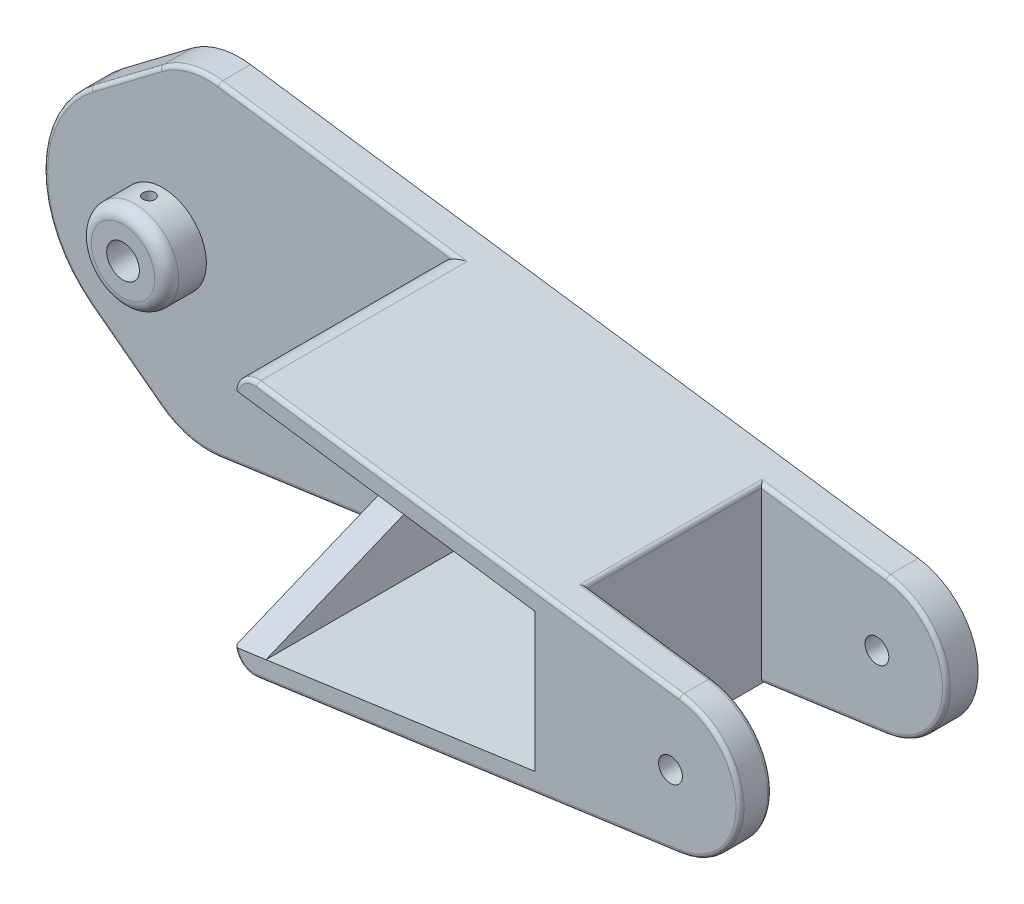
ISO-10303-21;
HEADER;
FILE_DESCRIPTION(('STEP AP214'),'2;1');
FILE_NAME('part.step','',(''),(''),'','','');
FILE_SCHEMA(('AUTOMOTIVE_DESIGN { 1 0 10303 214 1 1 1 1 }'));
ENDSEC;
DATA;
#1=APPLICATION_CONTEXT('core data for automotive mechanical design processes');
#2=APPLICATION_PROTOCOL_DEFINITION('international standard','automotive_design',2000,#1);
#3=PRODUCT_CONTEXT('',#1,'mechanical');
#4=PRODUCT('Part','Part','',(#3));
#5=PRODUCT_RELATED_PRODUCT_CATEGORY('part','',(#4));
#6=PRODUCT_DEFINITION_FORMATION('','',#4);
#7=PRODUCT_DEFINITION_CONTEXT('part definition',#1,'design');
#8=PRODUCT_DEFINITION('design','',#6,#7);
#9=PRODUCT_DEFINITION_SHAPE('','',#8);
#10=(LENGTH_UNIT() NAMED_UNIT(*) SI_UNIT(.MILLI.,.METRE.));
#11=(NAMED_UNIT(*) PLANE_ANGLE_UNIT() SI_UNIT($,.RADIAN.));
#12=(NAMED_UNIT(*) SI_UNIT($,.STERADIAN.) SOLID_ANGLE_UNIT());
#13=UNCERTAINTY_MEASURE_WITH_UNIT(LENGTH_MEASURE(1.E-05),#10,'distance_accuracy_value','');
#14=(GEOMETRIC_REPRESENTATION_CONTEXT(3) GLOBAL_UNCERTAINTY_ASSIGNED_CONTEXT((#13)) GLOBAL_UNIT_ASSIGNED_CONTEXT((#10,
#11,#12)) REPRESENTATION_CONTEXT('',''));
#15=CARTESIAN_POINT('',(0.,0.,0.));
#16=DIRECTION('',(0.,0.,1.));
#17=DIRECTION('',(1.,0.,0.));
#18=AXIS2_PLACEMENT_3D('',#15,#16,#17);
#19=CARTESIAN_POINT('',(-87.7032551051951,48.6612254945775,-3.));
#20=DIRECTION('',(0.,0.,1.));
#21=DIRECTION('',(1.,0.,0.));
#22=AXIS2_PLACEMENT_3D('',#19,#20,#21);
#23=CYLINDRICAL_SURFACE('',#22,4.125);
#24=CARTESIAN_POINT('',(-87.7032551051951,48.6612254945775,-3.));
#25=DIRECTION('',(0.,0.,1.));
#26=DIRECTION('',(1.,0.,0.));
#27=AXIS2_PLACEMENT_3D('',#24,#25,#26);
#28=CIRCLE('',#27,4.125);
#29=CARTESIAN_POINT('',(-83.5782551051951,48.6612254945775,-3.));
#30=VERTEX_POINT('',#29);
#31=EDGE_CURVE('E412',#30,#30,#28,.T.);
#32=ORIENTED_EDGE('',*,*,#31,.F.);
#33=EDGE_LOOP('',(#32));
#34=FACE_BOUND('',#33,.T.);
#35=CARTESIAN_POINT('',(-87.7032551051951,48.6612254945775,15.));
#36=DIRECTION('',(0.,0.,1.));
#37=DIRECTION('',(1.,0.,0.));
#38=AXIS2_PLACEMENT_3D('',#35,#36,#37);
#39=CIRCLE('',#38,4.125);
#40=CARTESIAN_POINT('',(-83.5782551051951,48.6612254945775,15.));
#41=VERTEX_POINT('',#40);
#42=EDGE_CURVE('E396',#41,#41,#39,.T.);
#43=ORIENTED_EDGE('',*,*,#42,.T.);
#44=EDGE_LOOP('',(#43));
#45=FACE_BOUND('',#44,.T.);
#46=CARTESIAN_POINT('',(-87.7032551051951,44.5362254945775,7.));
#47=CARTESIAN_POINT('',(-87.7846624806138,44.5362239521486,6.99999789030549));
#48=CARTESIAN_POINT('',(-87.8660550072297,44.5386567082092,7.00664814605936));
#49=CARTESIAN_POINT('',(-88.0264172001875,44.5481193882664,7.03297334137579));
#50=CARTESIAN_POINT('',(-88.1053870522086,44.5551489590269,7.05264728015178));
#51=CARTESIAN_POINT('',(-88.2585685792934,44.5730480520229,7.10423853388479));
#52=CARTESIAN_POINT('',(-88.3327887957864,44.5839104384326,7.13613310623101));
#53=CARTESIAN_POINT('',(-88.4748222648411,44.6083857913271,7.21114821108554));
#54=CARTESIAN_POINT('',(-88.5426339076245,44.6219994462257,7.25427155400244));
#55=CARTESIAN_POINT('',(-88.6726578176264,44.6511773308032,7.35233798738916));
#56=CARTESIAN_POINT('',(-88.7345772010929,44.6667944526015,7.40765353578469));
#57=CARTESIAN_POINT('',(-88.8484930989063,44.6979504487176,7.5277433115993));
#58=CARTESIAN_POINT('',(-88.9004868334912,44.7134892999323,7.592520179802));
#59=CARTESIAN_POINT('',(-88.9948829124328,44.7433351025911,7.73249128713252));
#60=CARTESIAN_POINT('',(-89.0368809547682,44.7575790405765,7.80797295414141));
#61=CARTESIAN_POINT('',(-89.1074571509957,44.782404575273,7.96552860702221));
#62=CARTESIAN_POINT('',(-89.1360403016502,44.792987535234,8.0476001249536));
#63=CARTESIAN_POINT('',(-89.1778351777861,44.8087298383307,8.21264399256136));
#64=CARTESIAN_POINT('',(-89.1916032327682,44.8140847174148,8.29545620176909));
#65=CARTESIAN_POINT('',(-89.2051167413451,44.8193386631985,8.46237531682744));
#66=CARTESIAN_POINT('',(-89.2048675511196,44.819239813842,8.54648171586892));
#67=CARTESIAN_POINT('',(-89.190780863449,44.813766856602,8.70861415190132));
#68=CARTESIAN_POINT('',(-89.1777015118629,44.8086870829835,8.78671780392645));
#69=CARTESIAN_POINT('',(-89.1395744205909,44.7943116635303,8.9395348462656));
#70=CARTESIAN_POINT('',(-89.1145249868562,44.7850154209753,9.01424775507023));
#71=CARTESIAN_POINT('',(-89.0527304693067,44.7630683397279,9.15975727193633));
#72=CARTESIAN_POINT('',(-89.0157809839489,44.7503595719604,9.23045795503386));
#73=CARTESIAN_POINT('',(-88.9313774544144,44.723040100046,9.36488106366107));
#74=CARTESIAN_POINT('',(-88.8839199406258,44.7084287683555,9.42860117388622));
#75=CARTESIAN_POINT('',(-88.7763301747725,44.6778287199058,9.55146978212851));
#76=CARTESIAN_POINT('',(-88.7155884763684,44.6618111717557,9.61007868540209));
#77=CARTESIAN_POINT('',(-88.5849497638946,44.6309973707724,9.71643325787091));
#78=CARTESIAN_POINT('',(-88.5150515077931,44.6162012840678,9.76417745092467));
#79=CARTESIAN_POINT('',(-88.3667737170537,44.5892338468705,9.84799537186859));
#80=CARTESIAN_POINT('',(-88.2882906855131,44.5771014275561,9.88389941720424));
#81=CARTESIAN_POINT('',(-88.1258485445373,44.5571150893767,9.94181885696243));
#82=CARTESIAN_POINT('',(-88.0418917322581,44.549259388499,9.96384003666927));
#83=CARTESIAN_POINT('',(-87.8754342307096,44.539019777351,9.99235450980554));
#84=CARTESIAN_POINT('',(-87.7930737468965,44.536379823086,9.99957509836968));
#85=CARTESIAN_POINT('',(-87.628285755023,44.5360845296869,10.000388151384));
#86=CARTESIAN_POINT('',(-87.5458582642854,44.5384281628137,9.99398342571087));
#87=CARTESIAN_POINT('',(-87.3863529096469,44.5476675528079,9.96828744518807));
#88=CARTESIAN_POINT('',(-87.309189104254,44.5543979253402,9.94946408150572));
#89=CARTESIAN_POINT('',(-87.159162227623,44.5715685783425,9.90007235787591));
#90=CARTESIAN_POINT('',(-87.0862997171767,44.5820093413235,9.86950247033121));
#91=CARTESIAN_POINT('',(-86.944607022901,44.6059337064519,9.79652833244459));
#92=CARTESIAN_POINT('',(-86.8759522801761,44.6194959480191,9.75380998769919));
#93=CARTESIAN_POINT('',(-86.7465620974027,44.6481515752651,9.65811017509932));
#94=CARTESIAN_POINT('',(-86.6858294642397,44.6632455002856,9.60512508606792));
#95=CARTESIAN_POINT('',(-86.570551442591,44.6943166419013,9.48699415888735));
#96=CARTESIAN_POINT('',(-86.5165233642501,44.7102971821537,9.42134308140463));
#97=CARTESIAN_POINT('',(-86.4201595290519,44.7405305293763,9.28158176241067));
#98=CARTESIAN_POINT('',(-86.3778245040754,44.7547832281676,9.20747099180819));
#99=CARTESIAN_POINT('',(-86.306086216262,44.7798598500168,9.05247028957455));
#100=CARTESIAN_POINT('',(-86.276710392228,44.7906764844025,8.97156640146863));
#101=CARTESIAN_POINT('',(-86.2321754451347,44.8073798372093,8.80546191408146));
#102=CARTESIAN_POINT('',(-86.2170082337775,44.8132693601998,8.72026378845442));
#103=CARTESIAN_POINT('',(-86.2020198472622,44.8190937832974,8.55355651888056));
#104=CARTESIAN_POINT('',(-86.2013233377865,44.8193683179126,8.47213722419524));
#105=CARTESIAN_POINT('',(-86.2130783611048,44.8147937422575,8.31040782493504));
#106=CARTESIAN_POINT('',(-86.2255287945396,44.8099450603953,8.23009762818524));
#107=CARTESIAN_POINT('',(-86.262558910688,44.7959451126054,8.07505378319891));
#108=CARTESIAN_POINT('',(-86.2868024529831,44.786913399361,8.00022815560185));
#109=CARTESIAN_POINT('',(-86.3464419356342,44.7656278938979,7.85565791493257));
#110=CARTESIAN_POINT('',(-86.3818406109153,44.7533733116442,7.78591455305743));
#111=CARTESIAN_POINT('',(-86.4648464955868,44.7262586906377,7.64969390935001));
#112=CARTESIAN_POINT('',(-86.5129764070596,44.71129889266,7.58355520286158));
#113=CARTESIAN_POINT('',(-86.619248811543,44.6808224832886,7.46001238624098));
#114=CARTESIAN_POINT('',(-86.6773943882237,44.6653057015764,7.40261097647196));
#115=CARTESIAN_POINT('',(-86.8055023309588,44.6345384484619,7.2952754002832));
#116=CARTESIAN_POINT('',(-86.875908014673,44.6193394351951,7.24585337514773));
#117=CARTESIAN_POINT('',(-87.0245532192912,44.5917419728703,7.15957219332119));
#118=CARTESIAN_POINT('',(-87.1027925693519,44.5793434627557,7.12271276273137));
#119=CARTESIAN_POINT('',(-87.2664379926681,44.5585762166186,7.06231774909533));
#120=CARTESIAN_POINT('',(-87.3519484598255,44.5502848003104,7.03903644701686));
#121=CARTESIAN_POINT('',(-87.5260644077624,44.5391114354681,7.00788201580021));
#122=CARTESIAN_POINT('',(-87.6146685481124,44.5362271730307,7.00000229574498));
#123=CARTESIAN_POINT('',(-87.7032551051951,44.5362254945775,7.));
#124=B_SPLINE_CURVE_WITH_KNOTS('',3,(#46,#47,#48,#49,#50,#51,#52,#53,#54,#55,#56,#57,#58,#59,
#60,#61,#62,#63,#64,#65,#66,#67,#68,#69,#70,#71,#72,#73,#74,#75,#76,#77,#78,#79,#80,#81,#82,#83,
#84,#85,#86,#87,#88,#89,#90,#91,#92,#93,#94,#95,#96,#97,#98,#99,#100,#101,#102,#103,#104,#105,
#106,#107,#108,#109,#110,#111,#112,#113,#114,#115,#116,#117,#118,#119,#120,#121,#122,#123),
.UNSPECIFIED.,.T.,.F.,(4,2,2,2,2,2,2,2,2,2,2,2,2,2,2,2,2,2,2,2,2,2,2,2,2,2,2,2,2,2,2,2,2,2,2,2,
2,2,4),(0.,0.243895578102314,0.487772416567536,0.731197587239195,0.974683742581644,
1.22701473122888,1.47941628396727,1.7407454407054,2.00197718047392,2.25301454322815,
2.50395598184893,2.74091069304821,2.97789894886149,3.21919683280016,3.46057450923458,
3.71713364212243,3.97372761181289,4.23385344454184,4.49387080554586,4.74077104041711,
4.98762036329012,5.22566309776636,5.46373679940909,5.70863443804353,5.95361861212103,
6.21194895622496,6.4702954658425,6.72918638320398,6.98792983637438,7.23097305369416,
7.47399594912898,7.71046530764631,7.94699268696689,8.19536750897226,8.44381893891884,
8.7046039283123,8.96538323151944,9.23090120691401,9.49630553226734),.UNSPECIFIED.);
#125=CARTESIAN_POINT('',(-87.7032551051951,44.5362254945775,7.));
#126=VERTEX_POINT('',#125);
#127=EDGE_CURVE('E726',#126,#126,#124,.T.);
#128=ORIENTED_EDGE('',*,*,#127,.F.);
#129=EDGE_LOOP('',(#128));
#130=FACE_BOUND('',#129,.T.);
#131=CARTESIAN_POINT('',(-87.7032551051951,52.7862254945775,7.));
#132=CARTESIAN_POINT('',(-87.6218477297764,52.7862270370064,6.99999789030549));
#133=CARTESIAN_POINT('',(-87.5404552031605,52.7837942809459,7.00664814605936));
#134=CARTESIAN_POINT('',(-87.3800930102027,52.7743316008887,7.03297334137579));
#135=CARTESIAN_POINT('',(-87.3011231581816,52.7673020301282,7.05264728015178));
#136=CARTESIAN_POINT('',(-87.1479416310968,52.7494029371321,7.10423853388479));
#137=CARTESIAN_POINT('',(-87.0737214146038,52.7385405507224,7.13613310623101));
#138=CARTESIAN_POINT('',(-86.9316879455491,52.714065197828,7.21114821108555));
#139=CARTESIAN_POINT('',(-86.8638763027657,52.7004515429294,7.25427155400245));
#140=CARTESIAN_POINT('',(-86.7338523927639,52.6712736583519,7.35233798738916));
#141=CARTESIAN_POINT('',(-86.6719330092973,52.6556565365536,7.40765353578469));
#142=CARTESIAN_POINT('',(-86.5580171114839,52.6245005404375,7.5277433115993));
#143=CARTESIAN_POINT('',(-86.506023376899,52.6089616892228,7.592520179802));
#144=CARTESIAN_POINT('',(-86.4116272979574,52.579115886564,7.73249128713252));
#145=CARTESIAN_POINT('',(-86.369629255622,52.5648719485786,7.80797295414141));
#146=CARTESIAN_POINT('',(-86.2990530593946,52.540046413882,7.96552860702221));
#147=CARTESIAN_POINT('',(-86.27046990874,52.529463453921,8.0476001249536));
#148=CARTESIAN_POINT('',(-86.2286750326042,52.5137211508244,8.21264399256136));
#149=CARTESIAN_POINT('',(-86.214906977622,52.5083662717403,8.29545620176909));
#150=CARTESIAN_POINT('',(-86.2013934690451,52.5031123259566,8.46237531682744));
#151=CARTESIAN_POINT('',(-86.2016426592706,52.5032111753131,8.54648171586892));
#152=CARTESIAN_POINT('',(-86.2157293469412,52.5086841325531,8.70861415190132));
#153=CARTESIAN_POINT('',(-86.2288086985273,52.5137639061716,8.78671780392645));
#154=CARTESIAN_POINT('',(-86.2669357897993,52.5281393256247,8.9395348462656));
#155=CARTESIAN_POINT('',(-86.2919852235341,52.5374355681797,9.01424775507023));
#156=CARTESIAN_POINT('',(-86.3537797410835,52.5593826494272,9.15975727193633));
#157=CARTESIAN_POINT('',(-86.3907292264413,52.5720914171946,9.23045795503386));
#158=CARTESIAN_POINT('',(-86.4751327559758,52.599410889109,9.36488106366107));
#159=CARTESIAN_POINT('',(-86.5225902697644,52.6140222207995,9.42860117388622));
#160=CARTESIAN_POINT('',(-86.6301800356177,52.6446222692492,9.55146978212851));
#161=CARTESIAN_POINT('',(-86.6909217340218,52.6606398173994,9.61007868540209));
#162=CARTESIAN_POINT('',(-86.8215604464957,52.6914536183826,9.71643325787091));
#163=CARTESIAN_POINT('',(-86.8914587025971,52.7062497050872,9.76417745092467));
#164=CARTESIAN_POINT('',(-87.0397364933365,52.7332171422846,9.84799537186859));
#165=CARTESIAN_POINT('',(-87.1182195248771,52.745349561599,9.88389941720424));
#166=CARTESIAN_POINT('',(-87.2806616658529,52.7653358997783,9.94181885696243));
#167=CARTESIAN_POINT('',(-87.3646184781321,52.7731916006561,9.96384003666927));
#168=CARTESIAN_POINT('',(-87.5310759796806,52.7834312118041,9.99235450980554));
#169=CARTESIAN_POINT('',(-87.6134364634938,52.786071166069,9.99957509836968));
#170=CARTESIAN_POINT('',(-87.7782244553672,52.7863664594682,10.000388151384));
#171=CARTESIAN_POINT('',(-87.8606519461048,52.7840228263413,9.99398342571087));
#172=CARTESIAN_POINT('',(-88.0201573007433,52.7747834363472,9.96828744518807));
#173=CARTESIAN_POINT('',(-88.0973211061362,52.7680530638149,9.94946408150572));
#174=CARTESIAN_POINT('',(-88.2473479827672,52.7508824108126,9.90007235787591));
#175=CARTESIAN_POINT('',(-88.3202104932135,52.7404416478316,9.86950247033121));
#176=CARTESIAN_POINT('',(-88.4619031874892,52.7165172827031,9.79652833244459));
#177=CARTESIAN_POINT('',(-88.5305579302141,52.7029550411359,9.75380998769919));
#178=CARTESIAN_POINT('',(-88.6599481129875,52.67429941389,9.65811017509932));
#179=CARTESIAN_POINT('',(-88.7206807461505,52.6592054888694,9.60512508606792));
#180=CARTESIAN_POINT('',(-88.8359587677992,52.6281343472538,9.48699415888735));
#181=CARTESIAN_POINT('',(-88.8899868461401,52.6121538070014,9.42134308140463));
#182=CARTESIAN_POINT('',(-88.9863506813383,52.5819204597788,9.28158176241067));
#183=CARTESIAN_POINT('',(-89.0286857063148,52.5676677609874,9.20747099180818));
#184=CARTESIAN_POINT('',(-89.1004239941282,52.5425911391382,9.05247028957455));
#185=CARTESIAN_POINT('',(-89.1297998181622,52.5317745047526,8.97156640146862));
#186=CARTESIAN_POINT('',(-89.1743347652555,52.5150711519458,8.80546191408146));
#187=CARTESIAN_POINT('',(-89.1895019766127,52.5091816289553,8.72026378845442));
#188=CARTESIAN_POINT('',(-89.204490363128,52.5033572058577,8.55355651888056));
#189=CARTESIAN_POINT('',(-89.2051868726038,52.5030826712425,8.47213722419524));
#190=CARTESIAN_POINT('',(-89.1934318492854,52.5076572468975,8.31040782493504));
#191=CARTESIAN_POINT('',(-89.1809814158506,52.5125059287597,8.23009762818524));
#192=CARTESIAN_POINT('',(-89.1439512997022,52.5265058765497,8.07505378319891));
#193=CARTESIAN_POINT('',(-89.1197077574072,52.535537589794,8.00022815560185));
#194=CARTESIAN_POINT('',(-89.060068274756,52.5568230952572,7.85565791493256));
#195=CARTESIAN_POINT('',(-89.0246695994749,52.5690776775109,7.78591455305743));
#196=CARTESIAN_POINT('',(-88.9416637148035,52.5961922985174,7.64969390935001));
#197=CARTESIAN_POINT('',(-88.8935338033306,52.6111520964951,7.58355520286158));
#198=CARTESIAN_POINT('',(-88.7872613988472,52.6416285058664,7.46001238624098));
#199=CARTESIAN_POINT('',(-88.7291158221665,52.6571452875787,7.40261097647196));
#200=CARTESIAN_POINT('',(-88.6010078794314,52.6879125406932,7.2952754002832));
#201=CARTESIAN_POINT('',(-88.5306021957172,52.70311155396,7.24585337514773));
#202=CARTESIAN_POINT('',(-88.381956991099,52.7307090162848,7.15957219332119));
#203=CARTESIAN_POINT('',(-88.3037176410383,52.7431075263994,7.12271276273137));
#204=CARTESIAN_POINT('',(-88.1400722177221,52.7638747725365,7.06231774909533));
#205=CARTESIAN_POINT('',(-88.0545617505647,52.7721661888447,7.03903644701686));
#206=CARTESIAN_POINT('',(-87.8804458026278,52.783339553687,7.00788201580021));
#207=CARTESIAN_POINT('',(-87.7918416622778,52.7862238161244,7.00000229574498));
#208=CARTESIAN_POINT('',(-87.7032551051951,52.7862254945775,7.));
#209=B_SPLINE_CURVE_WITH_KNOTS('',3,(#131,#132,#133,#134,#135,#136,#137,#138,#139,#140,#141,
#142,#143,#144,#145,#146,#147,#148,#149,#150,#151,#152,#153,#154,#155,#156,#157,#158,#159,#160,
#161,#162,#163,#164,#165,#166,#167,#168,#169,#170,#171,#172,#173,#174,#175,#176,#177,#178,#179,
#180,#181,#182,#183,#184,#185,#186,#187,#188,#189,#190,#191,#192,#193,#194,#195,#196,#197,#198,
#199,#200,#201,#202,#203,#204,#205,#206,#207,#208),.UNSPECIFIED.,.T.,.F.,(4,2,2,2,2,2,2,2,2,2,2,
2,2,2,2,2,2,2,2,2,2,2,2,2,2,2,2,2,2,2,2,2,2,2,2,2,2,2,4),(0.,0.243895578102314,
0.487772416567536,0.731197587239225,0.974683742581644,1.22701473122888,1.47941628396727,
1.7407454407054,2.00197718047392,2.25301454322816,2.50395598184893,2.74091069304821,
2.97789894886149,3.21919683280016,3.46057450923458,3.71713364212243,3.97372761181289,
4.23385344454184,4.49387080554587,4.74077104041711,4.98762036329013,5.22566309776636,
5.46373679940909,5.70863443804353,5.95361861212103,6.21194895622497,6.4702954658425,
6.72918638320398,6.98792983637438,7.23097305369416,7.47399594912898,7.71046530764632,
7.94699268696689,8.19536750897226,8.44381893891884,8.7046039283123,8.96538323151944,
9.23090120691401,9.49630553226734),.UNSPECIFIED.);
#210=CARTESIAN_POINT('',(-87.7032551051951,52.7862254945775,7.));
#211=VERTEX_POINT('',#210);
#212=EDGE_CURVE('E733',#211,#211,#209,.T.);
#213=ORIENTED_EDGE('',*,*,#212,.F.);
#214=EDGE_LOOP('',(#213));
#215=FACE_BOUND('',#214,.T.);
#216=ADVANCED_FACE('F70',(#34,#45,#130,#215),#23,.F.);
#217=CARTESIAN_POINT('',(-87.7032551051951,48.6612254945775,15.));
#218=DIRECTION('',(0.,0.,-1.));
#219=DIRECTION('',(-1.,0.,0.));
#220=AXIS2_PLACEMENT_3D('',#217,#218,#219);
#221=CYLINDRICAL_SURFACE('',#220,11.);
#222=CARTESIAN_POINT('',(-87.7032551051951,48.6612254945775,12.));
#223=DIRECTION('',(0.,0.,1.));
#224=DIRECTION('',(1.,0.,0.));
#225=AXIS2_PLACEMENT_3D('',#222,#223,#224);
#226=CIRCLE('',#225,11.);
#227=CARTESIAN_POINT('',(-76.7032551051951,48.6612254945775,12.));
#228=VERTEX_POINT('',#227);
#229=EDGE_CURVE('E12',#228,#228,#226,.F.);
#230=ORIENTED_EDGE('',*,*,#229,.T.);
#231=EDGE_LOOP('',(#230));
#232=FACE_BOUND('',#231,.T.);
#233=CARTESIAN_POINT('',(-87.7032551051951,48.6612254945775,5.));
#234=DIRECTION('',(0.,0.,1.));
#235=DIRECTION('',(1.,0.,0.));
#236=AXIS2_PLACEMENT_3D('',#233,#234,#235);
#237=CIRCLE('',#236,11.);
#238=CARTESIAN_POINT('',(-76.7032551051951,48.6612254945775,5.));
#239=VERTEX_POINT('',#238);
#240=EDGE_CURVE('E400',#239,#239,#237,.T.);
#241=ORIENTED_EDGE('',*,*,#240,.T.);
#242=EDGE_LOOP('',(#241));
#243=FACE_BOUND('',#242,.T.);
#244=CARTESIAN_POINT('',(-87.7032551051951,37.6612254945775,7.));
#245=CARTESIAN_POINT('',(-87.6194166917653,37.6612267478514,7.00000351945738));
#246=CARTESIAN_POINT('',(-87.5355275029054,37.6621940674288,7.00705259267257));
#247=CARTESIAN_POINT('',(-87.3700880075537,37.665959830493,7.03505888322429));
#248=CARTESIAN_POINT('',(-87.2885401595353,37.6687601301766,7.05603019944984));
#249=CARTESIAN_POINT('',(-87.1302020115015,37.6758767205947,7.11124773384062));
#250=CARTESIAN_POINT('',(-87.0534083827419,37.6801919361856,7.14548453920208));
#251=CARTESIAN_POINT('',(-86.9066698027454,37.6898597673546,7.22623952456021));
#252=CARTESIAN_POINT('',(-86.8367237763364,37.695212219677,7.27275577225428));
#253=CARTESIAN_POINT('',(-86.7051975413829,37.706396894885,7.37707221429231));
#254=CARTESIAN_POINT('',(-86.6436683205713,37.7122317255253,7.43493642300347));
#255=CARTESIAN_POINT('',(-86.5311617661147,37.7237027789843,7.5601686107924));
#256=CARTESIAN_POINT('',(-86.4801849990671,37.7293389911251,7.62753709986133));
#257=CARTESIAN_POINT('',(-86.3900365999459,37.7398001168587,7.77020193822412));
#258=CARTESIAN_POINT('',(-86.3509134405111,37.7446216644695,7.84552918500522));
#259=CARTESIAN_POINT('',(-86.2858924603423,37.7528725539,8.00176181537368));
#260=CARTESIAN_POINT('',(-86.2599940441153,37.7563019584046,8.08266694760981));
#261=CARTESIAN_POINT('',(-86.2223141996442,37.7613549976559,8.2472262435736));
#262=CARTESIAN_POINT('',(-86.2104461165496,37.7629897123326,8.33086021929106));
#263=CARTESIAN_POINT('',(-86.2008955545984,37.7643020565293,8.49894747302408));
#264=CARTESIAN_POINT('',(-86.2032124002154,37.7639797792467,8.58340071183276));
#265=CARTESIAN_POINT('',(-86.2218949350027,37.761424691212,8.7501217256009));
#266=CARTESIAN_POINT('',(-86.2381647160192,37.7592049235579,8.83240047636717));
#267=CARTESIAN_POINT('',(-86.2841414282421,37.7531253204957,8.99304904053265));
#268=CARTESIAN_POINT('',(-86.3138486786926,37.7492654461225,9.07141876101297));
#269=CARTESIAN_POINT('',(-86.385958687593,37.7403259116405,9.22231992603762));
#270=CARTESIAN_POINT('',(-86.4284026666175,37.73524230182,9.29483142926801));
#271=CARTESIAN_POINT('',(-86.5247518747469,37.7244310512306,9.43173914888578));
#272=CARTESIAN_POINT('',(-86.5786577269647,37.7187033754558,9.49613492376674));
#273=CARTESIAN_POINT('',(-86.6969298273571,37.7071915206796,9.61553955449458));
#274=CARTESIAN_POINT('',(-86.7613786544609,37.7014072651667,9.67046664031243));
#275=CARTESIAN_POINT('',(-86.8986241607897,37.6904780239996,9.76873649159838));
#276=CARTESIAN_POINT('',(-86.9714208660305,37.6853330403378,9.81207922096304));
#277=CARTESIAN_POINT('',(-87.1233621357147,37.6762579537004,9.88595186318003));
#278=CARTESIAN_POINT('',(-87.2025094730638,37.6723283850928,9.91647614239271));
#279=CARTESIAN_POINT('',(-87.3648720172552,37.6661315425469,9.96377783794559));
#280=CARTESIAN_POINT('',(-87.448086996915,37.6638641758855,9.98055602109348));
#281=CARTESIAN_POINT('',(-87.6155161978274,37.66125935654,9.99978208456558));
#282=CARTESIAN_POINT('',(-87.6997172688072,37.6609067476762,10.0023425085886));
#283=CARTESIAN_POINT('',(-87.8673473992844,37.6621301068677,9.99335812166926));
#284=CARTESIAN_POINT('',(-87.9507764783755,37.6637060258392,9.98181366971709));
#285=CARTESIAN_POINT('',(-88.1141584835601,37.6685999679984,9.94504077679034));
#286=CARTESIAN_POINT('',(-88.1941238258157,37.6719110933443,9.91986650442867));
#287=CARTESIAN_POINT('',(-88.3486982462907,37.6799050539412,9.85660524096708));
#288=CARTESIAN_POINT('',(-88.4233071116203,37.6845879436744,9.81851773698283));
#289=CARTESIAN_POINT('',(-88.5655499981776,37.6948418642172,9.73024246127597));
#290=CARTESIAN_POINT('',(-88.6331388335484,37.7004181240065,9.67998249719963));
#291=CARTESIAN_POINT('',(-88.7589621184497,37.7118199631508,9.56889042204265));
#292=CARTESIAN_POINT('',(-88.8171961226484,37.7176455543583,9.50805780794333));
#293=CARTESIAN_POINT('',(-88.9230604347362,37.7289368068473,9.3770491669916));
#294=CARTESIAN_POINT('',(-88.9706157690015,37.7343997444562,9.30681228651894));
#295=CARTESIAN_POINT('',(-89.0532535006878,37.7443008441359,9.15928169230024));
#296=CARTESIAN_POINT('',(-89.0883361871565,37.7487390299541,9.08198814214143));
#297=CARTESIAN_POINT('',(-89.1449136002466,37.7560690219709,8.92277224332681));
#298=CARTESIAN_POINT('',(-89.1664493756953,37.7589654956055,8.84086470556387));
#299=CARTESIAN_POINT('',(-89.1954532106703,37.7628970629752,8.67455347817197));
#300=CARTESIAN_POINT('',(-89.2029220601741,37.7639322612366,8.59014992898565));
#301=CARTESIAN_POINT('',(-89.2035636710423,37.7640206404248,8.42198902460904));
#302=CARTESIAN_POINT('',(-89.1968542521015,37.763090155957,8.3382321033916));
#303=CARTESIAN_POINT('',(-89.1695805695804,37.7593872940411,8.17304886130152));
#304=CARTESIAN_POINT('',(-89.149016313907,37.756614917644,8.09162253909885));
#305=CARTESIAN_POINT('',(-89.0946556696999,37.7495459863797,7.93343486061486));
#306=CARTESIAN_POINT('',(-89.060866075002,37.7452502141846,7.85667113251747));
#307=CARTESIAN_POINT('',(-88.9810255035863,37.7356173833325,7.70988370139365));
#308=CARTESIAN_POINT('',(-88.9349742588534,37.7302803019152,7.63986014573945));
#309=CARTESIAN_POINT('',(-88.8314842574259,37.719113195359,7.50793996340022));
#310=CARTESIAN_POINT('',(-88.7739578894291,37.7132795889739,7.44611236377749));
#311=CARTESIAN_POINT('',(-88.6493349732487,37.701807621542,7.33294465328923));
#312=CARTESIAN_POINT('',(-88.582236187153,37.696169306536,7.28160700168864));
#313=CARTESIAN_POINT('',(-88.4400205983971,37.6856945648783,7.19067403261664));
#314=CARTESIAN_POINT('',(-88.3648689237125,37.6808618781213,7.15113284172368));
#315=CARTESIAN_POINT('',(-88.2089647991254,37.6725801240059,7.08529051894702));
#316=CARTESIAN_POINT('',(-88.128218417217,37.6691295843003,7.0589752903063));
#317=CARTESIAN_POINT('',(-87.9897737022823,37.6648137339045,7.02648956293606));
#318=CARTESIAN_POINT('',(-87.9329408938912,37.6634748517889,7.01657063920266));
#319=CARTESIAN_POINT('',(-87.818498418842,37.6616803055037,7.00332467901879));
#320=CARTESIAN_POINT('',(-87.7608887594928,37.6612246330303,6.99999758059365));
#321=CARTESIAN_POINT('',(-87.7032551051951,37.6612254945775,7.));
#322=B_SPLINE_CURVE_WITH_KNOTS('',3,(#244,#245,#246,#247,#248,#249,#250,#251,#252,#253,#254,
#255,#256,#257,#258,#259,#260,#261,#262,#263,#264,#265,#266,#267,#268,#269,#270,#271,#272,#273,
#274,#275,#276,#277,#278,#279,#280,#281,#282,#283,#284,#285,#286,#287,#288,#289,#290,#291,#292,
#293,#294,#295,#296,#297,#298,#299,#300,#301,#302,#303,#304,#305,#306,#307,#308,#309,#310,#311,
#312,#313,#314,#315,#316,#317,#318,#319,#320,#321),.UNSPECIFIED.,.T.,.F.,(4,2,2,2,2,2,2,2,2,2,2,
2,2,2,2,2,2,2,2,2,2,2,2,2,2,2,2,2,2,2,2,2,2,2,2,2,2,2,4),(0.,0.251304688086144,
0.502864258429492,0.754245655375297,1.00558751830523,1.25839025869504,1.51120656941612,
1.76504317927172,2.01886835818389,2.27111752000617,2.52335466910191,2.77387178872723,
3.02439486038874,3.27573762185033,3.52709405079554,3.78052284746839,4.03395243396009,
4.2874932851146,4.54101999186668,4.79253696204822,5.04404753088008,5.29456578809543,
5.54509399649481,5.79714607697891,6.04921015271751,6.30299215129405,6.55676826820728,
6.80977166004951,7.06276084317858,7.31365598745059,7.5645509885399,7.81531727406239,
8.06608904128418,8.31885423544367,8.57167862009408,8.82564582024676,9.07934175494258,
9.25209960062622,9.42485582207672),.UNSPECIFIED.);
#323=CARTESIAN_POINT('',(-87.7032551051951,37.6612254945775,7.));
#324=VERTEX_POINT('',#323);
#325=EDGE_CURVE('E709',#324,#324,#322,.T.);
#326=ORIENTED_EDGE('',*,*,#325,.F.);
#327=EDGE_LOOP('',(#326));
#328=FACE_BOUND('',#327,.T.);
#329=CARTESIAN_POINT('',(-87.7032551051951,59.6612254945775,7.));
#330=CARTESIAN_POINT('',(-87.787093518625,59.6612242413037,7.00000351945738));
#331=CARTESIAN_POINT('',(-87.8709827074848,59.6602569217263,7.00705259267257));
#332=CARTESIAN_POINT('',(-88.0364222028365,59.656491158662,7.03505888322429));
#333=CARTESIAN_POINT('',(-88.117970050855,59.6536908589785,7.05603019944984));
#334=CARTESIAN_POINT('',(-88.2763081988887,59.6465742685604,7.11124773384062));
#335=CARTESIAN_POINT('',(-88.3531018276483,59.6422590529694,7.14548453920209));
#336=CARTESIAN_POINT('',(-88.4998404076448,59.6325912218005,7.22623952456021));
#337=CARTESIAN_POINT('',(-88.5697864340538,59.6272387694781,7.27275577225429));
#338=CARTESIAN_POINT('',(-88.7013126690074,59.6160540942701,7.37707221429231));
#339=CARTESIAN_POINT('',(-88.7628418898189,59.6102192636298,7.43493642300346));
#340=CARTESIAN_POINT('',(-88.8753484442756,59.5987482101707,7.56016861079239));
#341=CARTESIAN_POINT('',(-88.9263252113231,59.59311199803,7.62753709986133));
#342=CARTESIAN_POINT('',(-89.0164736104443,59.5826508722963,7.77020193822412));
#343=CARTESIAN_POINT('',(-89.0555967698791,59.5778293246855,7.84552918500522));
#344=CARTESIAN_POINT('',(-89.1206177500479,59.5695784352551,8.00176181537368));
#345=CARTESIAN_POINT('',(-89.146516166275,59.5661490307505,8.08266694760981));
#346=CARTESIAN_POINT('',(-89.184196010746,59.5610959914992,8.2472262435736));
#347=CARTESIAN_POINT('',(-89.1960640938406,59.5594612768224,8.33086021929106));
#348=CARTESIAN_POINT('',(-89.2056146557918,59.5581489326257,8.49894747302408));
#349=CARTESIAN_POINT('',(-89.2032978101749,59.5584712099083,8.58340071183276));
#350=CARTESIAN_POINT('',(-89.1846152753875,59.5610262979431,8.7501217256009));
#351=CARTESIAN_POINT('',(-89.168345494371,59.5632460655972,8.83240047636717));
#352=CARTESIAN_POINT('',(-89.1223687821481,59.5693256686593,8.99304904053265));
#353=CARTESIAN_POINT('',(-89.0926615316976,59.5731855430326,9.07141876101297));
#354=CARTESIAN_POINT('',(-89.0205515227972,59.5821250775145,9.22231992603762));
#355=CARTESIAN_POINT('',(-88.9781075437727,59.587208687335,9.29483142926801));
#356=CARTESIAN_POINT('',(-88.8817583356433,59.5980199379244,9.43173914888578));
#357=CARTESIAN_POINT('',(-88.8278524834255,59.6037476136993,9.49613492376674));
#358=CARTESIAN_POINT('',(-88.7095803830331,59.6152594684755,9.61553955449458));
#359=CARTESIAN_POINT('',(-88.6451315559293,59.6210437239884,9.67046664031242));
#360=CARTESIAN_POINT('',(-88.5078860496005,59.6319729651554,9.76873649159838));
#361=CARTESIAN_POINT('',(-88.4350893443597,59.6371179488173,9.81207922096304));
#362=CARTESIAN_POINT('',(-88.2831480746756,59.6461930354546,9.88595186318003));
#363=CARTESIAN_POINT('',(-88.2040007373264,59.6501226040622,9.91647614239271));
#364=CARTESIAN_POINT('',(-88.041638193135,59.6563194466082,9.96377783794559));
#365=CARTESIAN_POINT('',(-87.9584232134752,59.6585868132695,9.98055602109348));
#366=CARTESIAN_POINT('',(-87.7909940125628,59.6611916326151,9.99978208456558));
#367=CARTESIAN_POINT('',(-87.706792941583,59.6615442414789,10.0023425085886));
#368=CARTESIAN_POINT('',(-87.5391628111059,59.6603208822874,9.99335812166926));
#369=CARTESIAN_POINT('',(-87.4557337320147,59.6587449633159,9.98181366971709));
#370=CARTESIAN_POINT('',(-87.2923517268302,59.6538510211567,9.94504077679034));
#371=CARTESIAN_POINT('',(-87.2123863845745,59.6505398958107,9.91986650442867));
#372=CARTESIAN_POINT('',(-87.0578119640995,59.6425459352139,9.85660524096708));
#373=CARTESIAN_POINT('',(-86.9832030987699,59.6378630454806,9.81851773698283));
#374=CARTESIAN_POINT('',(-86.8409602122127,59.6276091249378,9.73024246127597));
#375=CARTESIAN_POINT('',(-86.7733713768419,59.6220328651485,9.67998249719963));
#376=CARTESIAN_POINT('',(-86.6475480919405,59.6106310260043,9.56889042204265));
#377=CARTESIAN_POINT('',(-86.5893140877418,59.6048054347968,9.50805780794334));
#378=CARTESIAN_POINT('',(-86.483449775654,59.5935141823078,9.3770491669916));
#379=CARTESIAN_POINT('',(-86.4358944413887,59.5880512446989,9.30681228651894));
#380=CARTESIAN_POINT('',(-86.3532567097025,59.5781501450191,9.15928169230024));
#381=CARTESIAN_POINT('',(-86.3181740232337,59.573711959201,9.08198814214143));
#382=CARTESIAN_POINT('',(-86.2615966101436,59.5663819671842,8.92277224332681));
#383=CARTESIAN_POINT('',(-86.240060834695,59.5634854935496,8.84086470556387));
#384=CARTESIAN_POINT('',(-86.2110569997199,59.5595539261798,8.67455347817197));
#385=CARTESIAN_POINT('',(-86.2035881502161,59.5585187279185,8.59014992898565));
#386=CARTESIAN_POINT('',(-86.2029465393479,59.5584303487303,8.42198902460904));
#387=CARTESIAN_POINT('',(-86.2096559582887,59.559360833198,8.3382321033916));
#388=CARTESIAN_POINT('',(-86.2369296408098,59.563063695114,8.17304886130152));
#389=CARTESIAN_POINT('',(-86.2574938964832,59.565836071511,8.09162253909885));
#390=CARTESIAN_POINT('',(-86.3118545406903,59.5729050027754,7.93343486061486));
#391=CARTESIAN_POINT('',(-86.3456441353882,59.5772007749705,7.85667113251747));
#392=CARTESIAN_POINT('',(-86.4254847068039,59.5868336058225,7.70988370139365));
#393=CARTESIAN_POINT('',(-86.4715359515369,59.5921706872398,7.63986014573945));
#394=CARTESIAN_POINT('',(-86.5750259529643,59.603337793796,7.50793996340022));
#395=CARTESIAN_POINT('',(-86.6325523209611,59.6091714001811,7.44611236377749));
#396=CARTESIAN_POINT('',(-86.7571752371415,59.6206433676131,7.33294465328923));
#397=CARTESIAN_POINT('',(-86.8242740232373,59.6262816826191,7.28160700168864));
#398=CARTESIAN_POINT('',(-86.9664896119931,59.6367564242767,7.19067403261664));
#399=CARTESIAN_POINT('',(-87.0416412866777,59.6415891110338,7.15113284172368));
#400=CARTESIAN_POINT('',(-87.1975454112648,59.6498708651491,7.08529051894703));
#401=CARTESIAN_POINT('',(-87.2782917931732,59.6533214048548,7.0589752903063));
#402=CARTESIAN_POINT('',(-87.4167365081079,59.6576372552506,7.02648956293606));
#403=CARTESIAN_POINT('',(-87.4735693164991,59.6589761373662,7.01657063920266));
#404=CARTESIAN_POINT('',(-87.5880117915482,59.6607706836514,7.00332467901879));
#405=CARTESIAN_POINT('',(-87.6456214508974,59.6612263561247,6.99999758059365));
#406=CARTESIAN_POINT('',(-87.7032551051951,59.6612254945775,7.));
#407=B_SPLINE_CURVE_WITH_KNOTS('',3,(#329,#330,#331,#332,#333,#334,#335,#336,#337,#338,#339,
#340,#341,#342,#343,#344,#345,#346,#347,#348,#349,#350,#351,#352,#353,#354,#355,#356,#357,#358,
#359,#360,#361,#362,#363,#364,#365,#366,#367,#368,#369,#370,#371,#372,#373,#374,#375,#376,#377,
#378,#379,#380,#381,#382,#383,#384,#385,#386,#387,#388,#389,#390,#391,#392,#393,#394,#395,#396,
#397,#398,#399,#400,#401,#402,#403,#404,#405,#406),.UNSPECIFIED.,.T.,.F.,(4,2,2,2,2,2,2,2,2,2,2,
2,2,2,2,2,2,2,2,2,2,2,2,2,2,2,2,2,2,2,2,2,2,2,2,2,2,2,4),(0.,0.251304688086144,
0.502864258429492,0.754245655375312,1.00558751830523,1.25839025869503,1.51120656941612,
1.76504317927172,2.01886835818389,2.27111752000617,2.52335466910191,2.77387178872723,
3.02439486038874,3.27573762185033,3.52709405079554,3.78052284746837,4.03395243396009,
4.2874932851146,4.54101999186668,4.79253696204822,5.04404753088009,5.29456578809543,
5.54509399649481,5.7971460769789,6.04921015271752,6.30299215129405,6.55676826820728,
6.80977166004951,7.06276084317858,7.31365598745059,7.5645509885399,7.81531727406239,
8.06608904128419,8.31885423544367,8.57167862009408,8.82564582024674,9.07934175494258,
9.25209960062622,9.42485582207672),.UNSPECIFIED.);
#408=CARTESIAN_POINT('',(-87.7032551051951,59.6612254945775,7.));
#409=VERTEX_POINT('',#408);
#410=EDGE_CURVE('E74',#409,#409,#407,.T.);
#411=ORIENTED_EDGE('',*,*,#410,.F.);
#412=EDGE_LOOP('',(#411));
#413=FACE_BOUND('',#412,.T.);
#414=ADVANCED_FACE('F702',(#232,#243,#328,#413),#221,.T.);
#415=CARTESIAN_POINT('',(92.2177637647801,48.6612254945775,5.));
#416=DIRECTION('',(0.,0.,1.));
#417=DIRECTION('',(1.,0.,0.));
#418=AXIS2_PLACEMENT_3D('',#415,#416,#417);
#419=PLANE('',#418);
#420=CARTESIAN_POINT('',(-76.3528942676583,27.5334043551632,5.));
#421=DIRECTION('',(0.,0.,1.));
#422=DIRECTION('',(1.,0.,0.));
#423=AXIS2_PLACEMENT_3D('',#420,#421,#422);
#424=CIRCLE('',#423,19.);
#425=CARTESIAN_POINT('',(-87.8170313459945,12.3817192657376,5.));
#426=VERTEX_POINT('',#425);
#427=CARTESIAN_POINT('',(-73.7128469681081,8.71771541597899,5.));
#428=VERTEX_POINT('',#427);
#429=EDGE_CURVE('E886',#426,#428,#424,.T.);
#430=ORIENTED_EDGE('',*,*,#429,.T.);
#431=DIRECTION('',(0.990299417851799,0.138949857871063,0.));
#432=VECTOR('',#431,1.);
#433=CARTESIAN_POINT('',(94.5104364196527,32.3212851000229,5.));
#434=LINE('',#433,#432);
#435=CARTESIAN_POINT('',(-15.0964145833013,16.9422430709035,5.));
#436=VERTEX_POINT('',#435);
#437=EDGE_CURVE('E883',#428,#436,#434,.T.);
#438=ORIENTED_EDGE('',*,*,#437,.T.);
#439=CARTESIAN_POINT('',(-12.6813157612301,21.3202903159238,5.));
#440=DIRECTION('',(0.,0.,1.));
#441=DIRECTION('',(1.,0.,0.));
#442=AXIS2_PLACEMENT_3D('',#439,#440,#441);
#443=CIRCLE('',#442,5.);
#444=CARTESIAN_POINT('',(-17.6328128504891,20.6255410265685,5.));
#445=VERTEX_POINT('',#444);
#446=EDGE_CURVE('E492',#436,#445,#443,.F.);
#447=ORIENTED_EDGE('',*,*,#446,.T.);
#448=DIRECTION('',(0.138949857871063,-0.990299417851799,0.));
#449=VECTOR('',#448,1.);
#450=CARTESIAN_POINT('',(-14.4542600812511,-2.0280910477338,5.));
#451=LINE('',#450,#449);
#452=CARTESIAN_POINT('',(-20.1339102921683,38.4509305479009,5.));
#453=VERTEX_POINT('',#452);
#454=EDGE_CURVE('E356',#453,#445,#451,.T.);
#455=ORIENTED_EDGE('',*,*,#454,.F.);
#456=DIRECTION('',(-0.990299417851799,-0.138949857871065,0.));
#457=VECTOR('',#456,1.);
#458=CARTESIAN_POINT('',(-12.211514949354,39.5625294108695,5.));
#459=LINE('',#458,#457);
#460=CARTESIAN_POINT('',(-12.211514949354,39.5625294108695,5.));
#461=VERTEX_POINT('',#460);
#462=EDGE_CURVE('E1722',#461,#453,#459,.T.);
#463=ORIENTED_EDGE('',*,*,#462,.F.);
#464=DIRECTION('',(0.138949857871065,-0.990299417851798,0.));
#465=VECTOR('',#464,1.);
#466=CARTESIAN_POINT('',(-9.01566821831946,16.7856428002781,5.));
#467=LINE('',#466,#465);
#468=CARTESIAN_POINT('',(-9.70367803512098,21.6891074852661,5.));
#469=VERTEX_POINT('',#468);
#470=EDGE_CURVE('E332',#461,#469,#467,.T.);
#471=ORIENTED_EDGE('',*,*,#470,.T.);
#472=DIRECTION('',(-0.990299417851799,-0.138949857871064,0.));
#473=VECTOR('',#472,1.);
#474=CARTESIAN_POINT('',(-3.17181329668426,22.6055996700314,5.));
#475=LINE('',#474,#473);
#476=CARTESIAN_POINT('',(58.1102516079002,31.2041447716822,5.));
#477=VERTEX_POINT('',#476);
#478=EDGE_CURVE('E343',#477,#469,#475,.T.);
#479=ORIENTED_EDGE('',*,*,#478,.F.);
#480=DIRECTION('',(0.,-1.,0.));
#481=VECTOR('',#480,1.);
#482=CARTESIAN_POINT('',(58.1102516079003,71.1183062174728,5.));
#483=LINE('',#482,#481);
#484=CARTESIAN_POINT('',(58.1102516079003,66.1183062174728,5.));
#485=VERTEX_POINT('',#484);
#486=EDGE_CURVE('E388',#485,#477,#483,.T.);
#487=ORIENTED_EDGE('',*,*,#486,.F.);
#488=DIRECTION('',(-0.990299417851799,0.138949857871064,0.));
#489=VECTOR('',#488,1.);
#490=CARTESIAN_POINT('',(58.1102516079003,66.1183062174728,5.));
#491=LINE('',#490,#489);
#492=CARTESIAN_POINT('',(-9.70367803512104,75.633343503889,5.));
#493=VERTEX_POINT('',#492);
#494=EDGE_CURVE('E364',#485,#493,#491,.T.);
#495=ORIENTED_EDGE('',*,*,#494,.T.);
#496=DIRECTION('',(-0.138949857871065,-0.990299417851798,0.));
#497=VECTOR('',#496,1.);
#498=CARTESIAN_POINT('',(-9.0156682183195,80.536808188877,5.));
#499=LINE('',#498,#497);
#500=CARTESIAN_POINT('',(-12.211514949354,57.7599215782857,5.));
#501=VERTEX_POINT('',#500);
#502=EDGE_CURVE('E1707',#493,#501,#499,.T.);
#503=ORIENTED_EDGE('',*,*,#502,.T.);
#504=DIRECTION('',(-0.990299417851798,0.138949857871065,0.));
#505=VECTOR('',#504,1.);
#506=CARTESIAN_POINT('',(-12.211514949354,57.7599215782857,5.));
#507=LINE('',#506,#505);
#508=CARTESIAN_POINT('',(-20.1339102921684,58.8715204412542,5.));
#509=VERTEX_POINT('',#508);
#510=EDGE_CURVE('E1702',#501,#509,#507,.T.);
#511=ORIENTED_EDGE('',*,*,#510,.T.);
#512=DIRECTION('',(0.138949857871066,0.990299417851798,0.));
#513=VECTOR('',#512,1.);
#514=CARTESIAN_POINT('',(-17.6260733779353,76.7449423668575,5.));
#515=LINE('',#514,#513);
#516=CARTESIAN_POINT('',(-17.6328128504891,76.6969099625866,5.));
#517=VERTEX_POINT('',#516);
#518=EDGE_CURVE('E1700',#509,#517,#515,.T.);
#519=ORIENTED_EDGE('',*,*,#518,.T.);
#520=CARTESIAN_POINT('',(-12.6813157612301,76.0021606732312,5.));
#521=DIRECTION('',(0.,0.,1.));
#522=DIRECTION('',(1.,0.,0.));
#523=AXIS2_PLACEMENT_3D('',#520,#521,#522);
#524=CIRCLE('',#523,5.);
#525=CARTESIAN_POINT('',(-15.0964145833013,80.3802079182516,5.));
#526=VERTEX_POINT('',#525);
#527=EDGE_CURVE('E495',#517,#526,#524,.F.);
#528=ORIENTED_EDGE('',*,*,#527,.T.);
#529=DIRECTION('',(-0.990299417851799,0.138949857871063,0.));
#530=VECTOR('',#529,1.);
#531=CARTESIAN_POINT('',(94.5104364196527,65.0011658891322,5.));
#532=LINE('',#531,#530);
#533=CARTESIAN_POINT('',(-73.7128469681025,88.6047355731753,5.));
#534=VERTEX_POINT('',#533);
#535=EDGE_CURVE('E840',#526,#534,#532,.T.);
#536=ORIENTED_EDGE('',*,*,#535,.T.);
#537=CARTESIAN_POINT('',(-76.3528942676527,69.7890466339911,5.));
#538=DIRECTION('',(0.,0.,1.));
#539=DIRECTION('',(1.,0.,0.));
#540=AXIS2_PLACEMENT_3D('',#537,#538,#539);
#541=CIRCLE('',#540,19.);
#542=CARTESIAN_POINT('',(-87.8170313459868,84.9407317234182,5.));
#543=VERTEX_POINT('',#542);
#544=EDGE_CURVE('E923',#534,#543,#541,.T.);
#545=ORIENTED_EDGE('',*,*,#544,.T.);
#546=DIRECTION('',(-0.797457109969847,-0.60337563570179,0.));
#547=VECTOR('',#546,1.);
#548=CARTESIAN_POINT('',(9.21743597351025,158.359392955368,5.));
#549=LINE('',#548,#547);
#550=CARTESIAN_POINT('',(-105.201148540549,71.7874816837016,5.));
#551=VERTEX_POINT('',#550);
#552=EDGE_CURVE('E918',#543,#551,#549,.T.);
#553=ORIENTED_EDGE('',*,*,#552,.T.);
#554=CARTESIAN_POINT('',(-87.7032551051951,48.6612254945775,5.));
#555=DIRECTION('',(0.,0.,1.));
#556=DIRECTION('',(1.,0.,0.));
#557=AXIS2_PLACEMENT_3D('',#554,#555,#556);
#558=CIRCLE('',#557,29.0000000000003);
#559=CARTESIAN_POINT('',(-105.201148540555,25.5349693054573,5.));
#560=VERTEX_POINT('',#559);
#561=EDGE_CURVE('E922',#551,#560,#558,.T.);
#562=ORIENTED_EDGE('',*,*,#561,.T.);
#563=DIRECTION('',(0.797457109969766,-0.603375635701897,0.));
#564=VECTOR('',#563,1.);
#565=CARTESIAN_POINT('',(9.21743597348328,-61.0369419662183,5.));
#566=LINE('',#565,#564);
#567=EDGE_CURVE('E927',#560,#426,#566,.T.);
#568=ORIENTED_EDGE('',*,*,#567,.T.);
#569=EDGE_LOOP('',(#430,#438,#447,#455,#463,#471,#479,#487,#495,#503,#511,#519,#528,#536,#545,
#553,#562,#568));
#570=FACE_BOUND('',#569,.T.);
#571=ORIENTED_EDGE('',*,*,#240,.F.);
#572=EDGE_LOOP('',(#571));
#573=FACE_BOUND('',#572,.T.);
#574=ADVANCED_FACE('F665',(#570,#573),#419,.T.);
#575=CARTESIAN_POINT('',(58.1102516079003,66.1183062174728,134.312191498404));
#576=DIRECTION('',(-0.138949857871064,-0.990299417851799,0.));
#577=DIRECTION('',(0.990299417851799,-0.138949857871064,0.));
#578=AXIS2_PLACEMENT_3D('',#575,#576,#577);
#579=PLANE('',#578);
#580=DIRECTION('',(0.990299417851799,-0.138949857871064,0.));
#581=VECTOR('',#580,1.);
#582=CARTESIAN_POINT('',(58.1102516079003,66.1183062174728,57.));
#583=LINE('',#582,#581);
#584=CARTESIAN_POINT('',(-9.70367803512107,75.633343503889,57.));
#585=VERTEX_POINT('',#584);
#586=CARTESIAN_POINT('',(58.1102516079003,66.1183062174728,57.));
#587=VERTEX_POINT('',#586);
#588=EDGE_CURVE('E1697',#585,#587,#583,.T.);
#589=ORIENTED_EDGE('',*,*,#588,.F.);
#590=DIRECTION('',(0.,0.,-1.));
#591=VECTOR('',#590,1.);
#592=CARTESIAN_POINT('',(-9.70367803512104,75.633343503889,134.312191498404));
#593=LINE('',#592,#591);
#594=EDGE_CURVE('E346',#585,#493,#593,.T.);
#595=ORIENTED_EDGE('',*,*,#594,.T.);
#596=ORIENTED_EDGE('',*,*,#494,.F.);
#597=DIRECTION('',(0.,0.,-1.));
#598=VECTOR('',#597,1.);
#599=CARTESIAN_POINT('',(58.1102516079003,66.1183062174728,134.312191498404));
#600=LINE('',#599,#598);
#601=EDGE_CURVE('E1696',#587,#485,#600,.T.);
#602=ORIENTED_EDGE('',*,*,#601,.F.);
#603=EDGE_LOOP('',(#589,#595,#596,#602));
#604=FACE_BOUND('',#603,.T.);
#605=ADVANCED_FACE('F661',(#604),#579,.T.);
#606=CARTESIAN_POINT('',(58.1102516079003,71.1183062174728,57.));
#607=DIRECTION('',(1.,0.,0.));
#608=DIRECTION('',(0.,1.,0.));
#609=AXIS2_PLACEMENT_3D('',#606,#607,#608);
#610=PLANE('',#609);
#611=DIRECTION('',(0.,-1.,0.));
#612=VECTOR('',#611,1.);
#613=CARTESIAN_POINT('',(58.1102516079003,71.1183062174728,57.));
#614=LINE('',#613,#612);
#615=CARTESIAN_POINT('',(58.1102516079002,31.2041447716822,57.));
#616=VERTEX_POINT('',#615);
#617=EDGE_CURVE('E351',#587,#616,#614,.T.);
#618=ORIENTED_EDGE('',*,*,#617,.F.);
#619=ORIENTED_EDGE('',*,*,#601,.T.);
#620=ORIENTED_EDGE('',*,*,#486,.T.);
#621=DIRECTION('',(0.,0.,-1.));
#622=VECTOR('',#621,1.);
#623=CARTESIAN_POINT('',(58.1102516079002,31.2041447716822,134.312191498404));
#624=LINE('',#623,#622);
#625=EDGE_CURVE('E354',#616,#477,#624,.T.);
#626=ORIENTED_EDGE('',*,*,#625,.F.);
#627=EDGE_LOOP('',(#618,#619,#620,#626));
#628=FACE_BOUND('',#627,.T.);
#629=ADVANCED_FACE('F664',(#628),#610,.F.);
#630=CARTESIAN_POINT('',(0.,0.,57.));
#631=DIRECTION('',(0.,0.,-1.));
#632=DIRECTION('',(-1.,0.,0.));
#633=AXIS2_PLACEMENT_3D('',#630,#631,#632);
#634=PLANE('',#633);
#635=DIRECTION('',(0.990299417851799,0.138949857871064,0.));
#636=VECTOR('',#635,1.);
#637=CARTESIAN_POINT('',(-3.17181329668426,22.6055996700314,57.));
#638=LINE('',#637,#636);
#639=CARTESIAN_POINT('',(-16.6354827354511,20.7164993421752,57.));
#640=VERTEX_POINT('',#639);
#641=CARTESIAN_POINT('',(-9.70367803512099,21.6891074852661,57.));
#642=VERTEX_POINT('',#641);
#643=EDGE_CURVE('E312',#640,#642,#638,.T.);
#644=ORIENTED_EDGE('',*,*,#643,.F.);
#645=CARTESIAN_POINT('',(-12.6813157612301,21.3202903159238,57.));
#646=DIRECTION('',(0.,0.,-1.));
#647=DIRECTION('',(-1.,0.,0.));
#648=AXIS2_PLACEMENT_3D('',#645,#646,#647);
#649=CIRCLE('',#648,4.);
#650=CARTESIAN_POINT('',(-12.1255163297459,17.3590926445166,57.));
#651=VERTEX_POINT('',#650);
#652=EDGE_CURVE('E593',#640,#651,#649,.F.);
#653=ORIENTED_EDGE('',*,*,#652,.T.);
#654=DIRECTION('',(0.990299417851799,0.138949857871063,0.));
#655=VECTOR('',#654,1.);
#656=CARTESIAN_POINT('',(94.5104364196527,32.3212851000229,57.));
#657=LINE('',#656,#655);
#658=CARTESIAN_POINT('',(94.5104364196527,32.3212851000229,57.));
#659=VERTEX_POINT('',#658);
#660=EDGE_CURVE('E557',#651,#659,#657,.T.);
#661=ORIENTED_EDGE('',*,*,#660,.T.);
#662=CARTESIAN_POINT('',(92.2177637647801,48.6612254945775,57.));
#663=DIRECTION('',(0.,0.,-1.));
#664=DIRECTION('',(-1.,0.,0.));
#665=AXIS2_PLACEMENT_3D('',#662,#663,#664);
#666=CIRCLE('',#665,16.5);
#667=CARTESIAN_POINT('',(94.5104364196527,65.0011658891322,57.));
#668=VERTEX_POINT('',#667);
#669=EDGE_CURVE('E584',#659,#668,#666,.F.);
#670=ORIENTED_EDGE('',*,*,#669,.T.);
#671=DIRECTION('',(-0.990299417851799,0.138949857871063,0.));
#672=VECTOR('',#671,1.);
#673=CARTESIAN_POINT('',(-12.1255163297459,79.9633583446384,57.));
#674=LINE('',#673,#672);
#675=CARTESIAN_POINT('',(-12.1255163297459,79.9633583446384,57.));
#676=VERTEX_POINT('',#675);
#677=EDGE_CURVE('E587',#668,#676,#674,.T.);
#678=ORIENTED_EDGE('',*,*,#677,.T.);
#679=CARTESIAN_POINT('',(-12.6813157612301,76.0021606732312,57.));
#680=DIRECTION('',(0.,0.,-1.));
#681=DIRECTION('',(-1.,0.,0.));
#682=AXIS2_PLACEMENT_3D('',#679,#680,#681);
#683=CIRCLE('',#682,4.);
#684=CARTESIAN_POINT('',(-16.6354827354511,76.6059516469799,57.));
#685=VERTEX_POINT('',#684);
#686=EDGE_CURVE('E590',#676,#685,#683,.F.);
#687=ORIENTED_EDGE('',*,*,#686,.T.);
#688=EDGE_CURVE('E360',#685,#585,#583,.T.);
#689=ORIENTED_EDGE('',*,*,#688,.T.);
#690=ORIENTED_EDGE('',*,*,#588,.T.);
#691=ORIENTED_EDGE('',*,*,#617,.T.);
#692=EDGE_CURVE('E325',#642,#616,#638,.T.);
#693=ORIENTED_EDGE('',*,*,#692,.F.);
#694=EDGE_LOOP('',(#644,#653,#661,#670,#678,#687,#689,#690,#691,#693));
#695=FACE_BOUND('',#694,.T.);
#696=CARTESIAN_POINT('',(92.2177637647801,48.6612254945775,57.));
#697=DIRECTION('',(0.,0.,1.));
#698=DIRECTION('',(1.,0.,0.));
#699=AXIS2_PLACEMENT_3D('',#696,#697,#698);
#700=CIRCLE('',#699,3.00000000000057);
#701=CARTESIAN_POINT('',(95.2177637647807,48.6612254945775,57.));
#702=VERTEX_POINT('',#701);
#703=EDGE_CURVE('E372',#702,#702,#700,.T.);
#704=ORIENTED_EDGE('',*,*,#703,.F.);
#705=EDGE_LOOP('',(#704));
#706=FACE_BOUND('',#705,.T.);
#707=ADVANCED_FACE('F348',(#695,#706),#634,.F.);
#708=CARTESIAN_POINT('',(112.1102516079,70.4167514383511,49.));
#709=DIRECTION('',(0.,0.,1.));
#710=DIRECTION('',(0.,-1.,0.));
#711=AXIS2_PLACEMENT_3D('',#708,#709,#710);
#712=PLANE('',#711);
#713=CARTESIAN_POINT('',(92.2177637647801,48.6612254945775,49.));
#714=DIRECTION('',(0.,0.,1.));
#715=DIRECTION('',(0.,-1.,0.));
#716=AXIS2_PLACEMENT_3D('',#713,#714,#715);
#717=CIRCLE('',#716,3.00000000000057);
#718=CARTESIAN_POINT('',(92.2177637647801,45.661225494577,49.));
#719=VERTEX_POINT('',#718);
#720=EDGE_CURVE('E379',#719,#719,#717,.T.);
#721=ORIENTED_EDGE('',*,*,#720,.T.);
#722=EDGE_LOOP('',(#721));
#723=FACE_BOUND('',#722,.T.);
#724=CARTESIAN_POINT('',(92.2177637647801,48.6612254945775,49.));
#725=DIRECTION('',(0.,0.,1.));
#726=DIRECTION('',(0.,-1.,0.));
#727=AXIS2_PLACEMENT_3D('',#724,#725,#726);
#728=CIRCLE('',#727,16.5);
#729=CARTESIAN_POINT('',(94.5104364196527,65.0011658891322,49.));
#730=VERTEX_POINT('',#729);
#731=CARTESIAN_POINT('',(94.5104364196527,32.3212851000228,49.));
#732=VERTEX_POINT('',#731);
#733=EDGE_CURVE('E522',#730,#732,#728,.F.);
#734=ORIENTED_EDGE('',*,*,#733,.T.);
#735=DIRECTION('',(0.990299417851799,0.138949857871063,0.));
#736=VECTOR('',#735,1.);
#737=CARTESIAN_POINT('',(62.9713017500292,27.8959989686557,49.));
#738=LINE('',#737,#736);
#739=CARTESIAN_POINT('',(63.1102516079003,27.9154951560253,49.));
#740=VERTEX_POINT('',#739);
#741=EDGE_CURVE('E525',#732,#740,#738,.F.);
#742=ORIENTED_EDGE('',*,*,#741,.T.);
#743=DIRECTION('',(0.,1.,0.));
#744=VECTOR('',#743,1.);
#745=CARTESIAN_POINT('',(63.1102516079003,70.4167514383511,49.));
#746=LINE('',#745,#744);
#747=CARTESIAN_POINT('',(63.1102516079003,69.4069558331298,49.));
#748=VERTEX_POINT('',#747);
#749=EDGE_CURVE('E380',#740,#748,#746,.T.);
#750=ORIENTED_EDGE('',*,*,#749,.T.);
#751=DIRECTION('',(-0.990299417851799,0.138949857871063,0.));
#752=VECTOR('',#751,1.);
#753=CARTESIAN_POINT('',(94.5104364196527,65.0011658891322,49.));
#754=LINE('',#753,#752);
#755=EDGE_CURVE('E519',#748,#730,#754,.F.);
#756=ORIENTED_EDGE('',*,*,#755,.T.);
#757=EDGE_LOOP('',(#734,#742,#750,#756));
#758=FACE_BOUND('',#757,.T.);
#759=ADVANCED_FACE('F685',(#723,#758),#712,.F.);
#760=CARTESIAN_POINT('',(63.1102516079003,70.4167514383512,57.));
#761=DIRECTION('',(-1.,0.,0.));
#762=DIRECTION('',(0.,0.,1.));
#763=AXIS2_PLACEMENT_3D('',#760,#761,#762);
#764=PLANE('',#763);
#765=CARTESIAN_POINT('',(63.1102516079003,69.4069558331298,4.));
#766=DIRECTION('',(-1.,0.,0.));
#767=DIRECTION('',(0.,1.,0.));
#768=AXIS2_PLACEMENT_3D('',#765,#766,#767);
#769=ELLIPSE('',#768,1.00979560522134,1.);
#770=CARTESIAN_POINT('',(63.1102516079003,69.4069558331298,5.));
#771=VERTEX_POINT('',#770);
#772=CARTESIAN_POINT('',(63.1102516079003,69.5472667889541,4.99029941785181));
#773=VERTEX_POINT('',#772);
#774=EDGE_CURVE('E550',#771,#773,#769,.T.);
#775=ORIENTED_EDGE('',*,*,#774,.T.);
#776=DIRECTION('',(0.,0.,-1.));
#777=VECTOR('',#776,1.);
#778=CARTESIAN_POINT('',(63.1102516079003,69.5472667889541,49.));
#779=LINE('',#778,#777);
#780=CARTESIAN_POINT('',(63.1102516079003,69.5472667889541,49.0097005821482));
#781=VERTEX_POINT('',#780);
#782=EDGE_CURVE('E540',#773,#781,#779,.F.);
#783=ORIENTED_EDGE('',*,*,#782,.T.);
#784=CARTESIAN_POINT('',(63.1102516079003,69.4069558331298,50.));
#785=DIRECTION('',(-1.,0.,0.));
#786=DIRECTION('',(0.,-1.,0.));
#787=AXIS2_PLACEMENT_3D('',#784,#785,#786);
#788=ELLIPSE('',#787,1.00979560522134,1.);
#789=EDGE_CURVE('E554',#781,#748,#788,.T.);
#790=ORIENTED_EDGE('',*,*,#789,.T.);
#791=ORIENTED_EDGE('',*,*,#749,.F.);
#792=CARTESIAN_POINT('',(63.1102516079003,27.9154951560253,50.));
#793=DIRECTION('',(-1.,0.,0.));
#794=DIRECTION('',(0.,-1.,0.));
#795=AXIS2_PLACEMENT_3D('',#792,#793,#794);
#796=ELLIPSE('',#795,1.00979560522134,1.);
#797=CARTESIAN_POINT('',(63.1102516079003,26.9056995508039,50.));
#798=VERTEX_POINT('',#797);
#799=EDGE_CURVE('E546',#740,#798,#796,.T.);
#800=ORIENTED_EDGE('',*,*,#799,.T.);
#801=DIRECTION('',(0.,0.,-1.));
#802=VECTOR('',#801,1.);
#803=CARTESIAN_POINT('',(63.1102516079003,26.9056995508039,57.));
#804=LINE('',#803,#802);
#805=CARTESIAN_POINT('',(63.1102516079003,26.9056995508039,4.00000000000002));
#806=VERTEX_POINT('',#805);
#807=EDGE_CURVE('E387',#798,#806,#804,.T.);
#808=ORIENTED_EDGE('',*,*,#807,.T.);
#809=CARTESIAN_POINT('',(63.1102516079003,27.9154951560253,4.));
#810=DIRECTION('',(-1.,0.,0.));
#811=DIRECTION('',(0.,1.,0.));
#812=AXIS2_PLACEMENT_3D('',#809,#810,#811);
#813=ELLIPSE('',#812,1.00979560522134,1.);
#814=CARTESIAN_POINT('',(63.1102516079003,27.9154951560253,5.));
#815=VERTEX_POINT('',#814);
#816=EDGE_CURVE('E543',#806,#815,#813,.T.);
#817=ORIENTED_EDGE('',*,*,#816,.T.);
#818=DIRECTION('',(0.,1.,0.));
#819=VECTOR('',#818,1.);
#820=CARTESIAN_POINT('',(63.1102516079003,70.4167514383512,5.));
#821=LINE('',#820,#819);
#822=EDGE_CURVE('E384',#815,#771,#821,.T.);
#823=ORIENTED_EDGE('',*,*,#822,.T.);
#824=EDGE_LOOP('',(#775,#783,#790,#791,#800,#808,#817,#823));
#825=FACE_BOUND('',#824,.T.);
#826=ADVANCED_FACE('F688',(#825),#764,.F.);
#827=CARTESIAN_POINT('',(92.2177637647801,48.6612254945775,5.));
#828=DIRECTION('',(0.,0.,1.));
#829=DIRECTION('',(1.,0.,0.));
#830=AXIS2_PLACEMENT_3D('',#827,#828,#829);
#831=CIRCLE('',#830,3.00000000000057);
#832=CARTESIAN_POINT('',(95.2177637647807,48.6612254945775,5.));
#833=VERTEX_POINT('',#832);
#834=EDGE_CURVE('E404',#833,#833,#831,.T.);
#835=ORIENTED_EDGE('',*,*,#834,.F.);
#836=EDGE_LOOP('',(#835));
#837=FACE_BOUND('',#836,.T.);
#838=ORIENTED_EDGE('',*,*,#822,.F.);
#839=DIRECTION('',(0.990299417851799,0.138949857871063,0.));
#840=VECTOR('',#839,1.);
#841=CARTESIAN_POINT('',(94.5104364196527,32.3212851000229,5.));
#842=LINE('',#841,#840);
#843=CARTESIAN_POINT('',(94.5104364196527,32.3212851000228,5.));
#844=VERTEX_POINT('',#843);
#845=EDGE_CURVE('E505',#815,#844,#842,.T.);
#846=ORIENTED_EDGE('',*,*,#845,.T.);
#847=CARTESIAN_POINT('',(92.2177637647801,48.6612254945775,5.));
#848=DIRECTION('',(0.,0.,1.));
#849=DIRECTION('',(1.,0.,0.));
#850=AXIS2_PLACEMENT_3D('',#847,#848,#849);
#851=CIRCLE('',#850,16.5);
#852=CARTESIAN_POINT('',(94.5104364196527,65.0011658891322,5.));
#853=VERTEX_POINT('',#852);
#854=EDGE_CURVE('E502',#844,#853,#851,.T.);
#855=ORIENTED_EDGE('',*,*,#854,.T.);
#856=DIRECTION('',(-0.990299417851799,0.138949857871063,0.));
#857=VECTOR('',#856,1.);
#858=CARTESIAN_POINT('',(94.5104364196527,65.0011658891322,5.));
#859=LINE('',#858,#857);
#860=EDGE_CURVE('E499',#853,#771,#859,.T.);
#861=ORIENTED_EDGE('',*,*,#860,.T.);
#862=EDGE_LOOP('',(#838,#846,#855,#861));
#863=FACE_BOUND('',#862,.T.);
#864=ADVANCED_FACE('F697',(#837,#863),#419,.T.);
#865=CARTESIAN_POINT('',(92.2177637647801,48.6612254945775,-3.));
#866=DIRECTION('',(0.,0.,1.));
#867=DIRECTION('',(1.,0.,0.));
#868=AXIS2_PLACEMENT_3D('',#865,#866,#867);
#869=CYLINDRICAL_SURFACE('',#868,17.5);
#870=DIRECTION('',(0.,0.,1.));
#871=VECTOR('',#870,1.);
#872=CARTESIAN_POINT('',(94.6493862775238,65.991465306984,-3.));
#873=LINE('',#872,#871);
#874=CARTESIAN_POINT('',(94.6493862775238,65.991465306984,-3.));
#875=VERTEX_POINT('',#874);
#876=CARTESIAN_POINT('',(94.6493862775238,65.991465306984,4.));
#877=VERTEX_POINT('',#876);
#878=EDGE_CURVE('E446',#875,#877,#873,.T.);
#879=ORIENTED_EDGE('',*,*,#878,.T.);
#880=CARTESIAN_POINT('',(92.2177637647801,48.6612254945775,4.));
#881=DIRECTION('',(0.,0.,1.));
#882=DIRECTION('',(1.,0.,0.));
#883=AXIS2_PLACEMENT_3D('',#880,#881,#882);
#884=CIRCLE('',#883,17.5);
#885=CARTESIAN_POINT('',(94.6493862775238,31.330985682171,4.));
#886=VERTEX_POINT('',#885);
#887=EDGE_CURVE('E516',#877,#886,#884,.F.);
#888=ORIENTED_EDGE('',*,*,#887,.T.);
#889=DIRECTION('',(0.,0.,1.));
#890=VECTOR('',#889,1.);
#891=CARTESIAN_POINT('',(94.6493862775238,31.330985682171,-3.));
#892=LINE('',#891,#890);
#893=CARTESIAN_POINT('',(94.6493862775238,31.330985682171,-3.));
#894=VERTEX_POINT('',#893);
#895=EDGE_CURVE('E447',#894,#886,#892,.T.);
#896=ORIENTED_EDGE('',*,*,#895,.F.);
#897=CARTESIAN_POINT('',(92.2177637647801,48.6612254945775,-3.));
#898=DIRECTION('',(0.,0.,1.));
#899=DIRECTION('',(1.,0.,0.));
#900=AXIS2_PLACEMENT_3D('',#897,#898,#899);
#901=CIRCLE('',#900,17.5);
#902=EDGE_CURVE('E416',#894,#875,#901,.T.);
#903=ORIENTED_EDGE('',*,*,#902,.T.);
#904=EDGE_LOOP('',(#879,#888,#896,#903));
#905=FACE_BOUND('',#904,.T.);
#906=ADVANCED_FACE('F751',(#905),#869,.T.);
#907=CARTESIAN_POINT('',(94.6493862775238,31.330985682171,-3.));
#908=DIRECTION('',(0.138949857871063,-0.990299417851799,0.));
#909=DIRECTION('',(0.990299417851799,0.138949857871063,0.));
#910=AXIS2_PLACEMENT_3D('',#907,#908,#909);
#911=PLANE('',#910);
#912=DIRECTION('',(0.,0.,-1.));
#913=VECTOR('',#912,1.);
#914=CARTESIAN_POINT('',(-11.9865664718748,16.3687932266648,5.));
#915=LINE('',#914,#913);
#916=CARTESIAN_POINT('',(-11.9865664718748,16.3687932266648,56.));
#917=VERTEX_POINT('',#916);
#918=CARTESIAN_POINT('',(-11.9865664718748,16.3687932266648,4.));
#919=VERTEX_POINT('',#918);
#920=EDGE_CURVE('E345',#917,#919,#915,.T.);
#921=ORIENTED_EDGE('',*,*,#920,.T.);
#922=DIRECTION('',(0.990299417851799,0.138949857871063,0.));
#923=VECTOR('',#922,1.);
#924=CARTESIAN_POINT('',(94.6493862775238,31.330985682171,4.));
#925=LINE('',#924,#923);
#926=CARTESIAN_POINT('',(-73.573897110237,7.72741599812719,4.));
#927=VERTEX_POINT('',#926);
#928=EDGE_CURVE('E881',#919,#927,#925,.F.);
#929=ORIENTED_EDGE('',*,*,#928,.T.);
#930=DIRECTION('',(0.,0.,1.));
#931=VECTOR('',#930,1.);
#932=CARTESIAN_POINT('',(-73.573897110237,7.72741599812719,-3.));
#933=LINE('',#932,#931);
#934=CARTESIAN_POINT('',(-73.573897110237,7.72741599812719,-3.));
#935=VERTEX_POINT('',#934);
#936=EDGE_CURVE('E451',#935,#927,#933,.T.);
#937=ORIENTED_EDGE('',*,*,#936,.F.);
#938=DIRECTION('',(0.990299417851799,0.138949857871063,0.));
#939=VECTOR('',#938,1.);
#940=CARTESIAN_POINT('',(94.6493862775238,31.330985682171,-3.));
#941=LINE('',#940,#939);
#942=EDGE_CURVE('E443',#935,#894,#941,.T.);
#943=ORIENTED_EDGE('',*,*,#942,.T.);
#944=ORIENTED_EDGE('',*,*,#895,.T.);
#945=DIRECTION('',(0.990299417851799,0.138949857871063,0.));
#946=VECTOR('',#945,1.);
#947=CARTESIAN_POINT('',(94.6493862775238,31.330985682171,4.));
#948=LINE('',#947,#946);
#949=EDGE_CURVE('E512',#886,#806,#948,.F.);
#950=ORIENTED_EDGE('',*,*,#949,.T.);
#951=ORIENTED_EDGE('',*,*,#807,.F.);
#952=DIRECTION('',(0.990299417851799,0.138949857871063,0.));
#953=VECTOR('',#952,1.);
#954=CARTESIAN_POINT('',(94.6493862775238,31.330985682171,50.));
#955=LINE('',#954,#953);
#956=CARTESIAN_POINT('',(94.6493862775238,31.3309856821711,50.));
#957=VERTEX_POINT('',#956);
#958=EDGE_CURVE('E509',#798,#957,#955,.T.);
#959=ORIENTED_EDGE('',*,*,#958,.T.);
#960=DIRECTION('',(0.,0.,1.));
#961=VECTOR('',#960,1.);
#962=CARTESIAN_POINT('',(94.6493862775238,31.3309856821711,-3.));
#963=LINE('',#962,#961);
#964=CARTESIAN_POINT('',(94.6493862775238,31.3309856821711,56.));
#965=VERTEX_POINT('',#964);
#966=EDGE_CURVE('E324',#957,#965,#963,.T.);
#967=ORIENTED_EDGE('',*,*,#966,.T.);
#968=DIRECTION('',(0.990299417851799,0.138949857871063,0.));
#969=VECTOR('',#968,1.);
#970=CARTESIAN_POINT('',(-11.9865664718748,16.3687932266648,56.));
#971=LINE('',#970,#969);
#972=EDGE_CURVE('E956',#965,#917,#971,.F.);
#973=ORIENTED_EDGE('',*,*,#972,.T.);
#974=EDGE_LOOP('',(#921,#929,#937,#943,#944,#950,#951,#959,#967,#973));
#975=FACE_BOUND('',#974,.T.);
#976=ADVANCED_FACE('F747',(#975),#911,.T.);
#977=CARTESIAN_POINT('',(-76.3528942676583,27.5334043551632,-3.));
#978=DIRECTION('',(0.,0.,1.));
#979=DIRECTION('',(1.,0.,0.));
#980=AXIS2_PLACEMENT_3D('',#977,#978,#979);
#981=CYLINDRICAL_SURFACE('',#980,20.);
#982=ORIENTED_EDGE('',*,*,#936,.T.);
#983=CARTESIAN_POINT('',(-76.3528942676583,27.5334043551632,4.));
#984=DIRECTION('',(0.,0.,1.));
#985=DIRECTION('',(1.,0.,0.));
#986=AXIS2_PLACEMENT_3D('',#983,#984,#985);
#987=CIRCLE('',#986,20.);
#988=CARTESIAN_POINT('',(-88.4204069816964,11.5842621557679,4.));
#989=VERTEX_POINT('',#988);
#990=EDGE_CURVE('E887',#927,#989,#987,.F.);
#991=ORIENTED_EDGE('',*,*,#990,.T.);
#992=DIRECTION('',(0.,0.,1.));
#993=VECTOR('',#992,1.);
#994=CARTESIAN_POINT('',(-88.4204069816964,11.5842621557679,-3.));
#995=LINE('',#994,#993);
#996=CARTESIAN_POINT('',(-88.4204069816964,11.5842621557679,-3.));
#997=VERTEX_POINT('',#996);
#998=EDGE_CURVE('E455',#997,#989,#995,.T.);
#999=ORIENTED_EDGE('',*,*,#998,.F.);
#1000=CARTESIAN_POINT('',(-76.3528942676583,27.5334043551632,-3.));
#1001=DIRECTION('',(0.,0.,1.));
#1002=DIRECTION('',(-1.,0.,0.));
#1003=AXIS2_PLACEMENT_3D('',#1000,#1001,#1002);
#1004=CIRCLE('',#1003,20.);
#1005=EDGE_CURVE('E439',#997,#935,#1004,.T.);
#1006=ORIENTED_EDGE('',*,*,#1005,.T.);
#1007=EDGE_LOOP('',(#982,#991,#999,#1006));
#1008=FACE_BOUND('',#1007,.T.);
#1009=ADVANCED_FACE('F750',(#1008),#981,.T.);
#1010=CARTESIAN_POINT('',(-105.804524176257,24.7375121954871,-3.));
#1011=DIRECTION('',(-0.603375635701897,-0.797457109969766,0.));
#1012=DIRECTION('',(0.797457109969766,-0.603375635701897,0.));
#1013=AXIS2_PLACEMENT_3D('',#1010,#1011,#1012);
#1014=PLANE('',#1013);
#1015=ORIENTED_EDGE('',*,*,#998,.T.);
#1016=DIRECTION('',(0.797457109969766,-0.603375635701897,0.));
#1017=VECTOR('',#1016,1.);
#1018=CARTESIAN_POINT('',(-105.804524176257,24.7375121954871,4.));
#1019=LINE('',#1018,#1017);
#1020=CARTESIAN_POINT('',(-105.804524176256,24.7375121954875,4.));
#1021=VERTEX_POINT('',#1020);
#1022=EDGE_CURVE('E890',#989,#1021,#1019,.F.);
#1023=ORIENTED_EDGE('',*,*,#1022,.T.);
#1024=DIRECTION('',(0.,0.,1.));
#1025=VECTOR('',#1024,1.);
#1026=CARTESIAN_POINT('',(-105.804524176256,24.7375121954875,-3.));
#1027=LINE('',#1026,#1025);
#1028=CARTESIAN_POINT('',(-105.804524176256,24.7375121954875,-3.));
#1029=VERTEX_POINT('',#1028);
#1030=EDGE_CURVE('E459',#1029,#1021,#1027,.T.);
#1031=ORIENTED_EDGE('',*,*,#1030,.F.);
#1032=DIRECTION('',(0.797457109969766,-0.603375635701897,0.));
#1033=VECTOR('',#1032,1.);
#1034=CARTESIAN_POINT('',(-105.804524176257,24.7375121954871,-3.));
#1035=LINE('',#1034,#1033);
#1036=EDGE_CURVE('E435',#1029,#997,#1035,.T.);
#1037=ORIENTED_EDGE('',*,*,#1036,.T.);
#1038=EDGE_LOOP('',(#1015,#1023,#1031,#1037));
#1039=FACE_BOUND('',#1038,.T.);
#1040=ADVANCED_FACE('F755',(#1039),#1014,.T.);
#1041=CARTESIAN_POINT('',(-87.7032551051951,48.6612254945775,-3.));
#1042=DIRECTION('',(0.,0.,1.));
#1043=DIRECTION('',(1.,0.,0.));
#1044=AXIS2_PLACEMENT_3D('',#1041,#1042,#1043);
#1045=CYLINDRICAL_SURFACE('',#1044,30.0000000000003);
#1046=ORIENTED_EDGE('',*,*,#1030,.T.);
#1047=CARTESIAN_POINT('',(-87.7032551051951,48.6612254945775,4.));
#1048=DIRECTION('',(0.,0.,1.));
#1049=DIRECTION('',(1.,0.,0.));
#1050=AXIS2_PLACEMENT_3D('',#1047,#1048,#1049);
#1051=CIRCLE('',#1050,30.0000000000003);
#1052=CARTESIAN_POINT('',(-105.80452417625,72.5849387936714,4.));
#1053=VERTEX_POINT('',#1052);
#1054=EDGE_CURVE('E894',#1021,#1053,#1051,.F.);
#1055=ORIENTED_EDGE('',*,*,#1054,.T.);
#1056=DIRECTION('',(0.,0.,1.));
#1057=VECTOR('',#1056,1.);
#1058=CARTESIAN_POINT('',(-105.80452417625,72.5849387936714,-3.));
#1059=LINE('',#1058,#1057);
#1060=CARTESIAN_POINT('',(-105.80452417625,72.5849387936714,-3.));
#1061=VERTEX_POINT('',#1060);
#1062=EDGE_CURVE('E463',#1061,#1053,#1059,.T.);
#1063=ORIENTED_EDGE('',*,*,#1062,.F.);
#1064=CARTESIAN_POINT('',(-87.7032551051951,48.6612254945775,-3.));
#1065=DIRECTION('',(0.,0.,1.));
#1066=DIRECTION('',(1.,0.,0.));
#1067=AXIS2_PLACEMENT_3D('',#1064,#1065,#1066);
#1068=CIRCLE('',#1067,30.0000000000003);
#1069=EDGE_CURVE('E431',#1061,#1029,#1068,.T.);
#1070=ORIENTED_EDGE('',*,*,#1069,.T.);
#1071=EDGE_LOOP('',(#1046,#1055,#1063,#1070));
#1072=FACE_BOUND('',#1071,.T.);
#1073=ADVANCED_FACE('F759',(#1072),#1045,.T.);
#1074=CARTESIAN_POINT('',(-105.80452417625,72.5849387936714,-3.));
#1075=DIRECTION('',(-0.60337563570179,0.797457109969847,0.));
#1076=DIRECTION('',(-0.797457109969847,-0.60337563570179,0.));
#1077=AXIS2_PLACEMENT_3D('',#1074,#1075,#1076);
#1078=PLANE('',#1077);
#1079=ORIENTED_EDGE('',*,*,#1062,.T.);
#1080=DIRECTION('',(-0.797457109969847,-0.60337563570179,0.));
#1081=VECTOR('',#1080,1.);
#1082=CARTESIAN_POINT('',(-105.80452417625,72.5849387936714,4.));
#1083=LINE('',#1082,#1081);
#1084=CARTESIAN_POINT('',(-88.4204069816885,85.7381888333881,4.));
#1085=VERTEX_POINT('',#1084);
#1086=EDGE_CURVE('E901',#1053,#1085,#1083,.F.);
#1087=ORIENTED_EDGE('',*,*,#1086,.T.);
#1088=DIRECTION('',(0.,0.,1.));
#1089=VECTOR('',#1088,1.);
#1090=CARTESIAN_POINT('',(-88.4204069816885,85.7381888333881,-3.));
#1091=LINE('',#1090,#1089);
#1092=CARTESIAN_POINT('',(-88.4204069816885,85.7381888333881,-3.));
#1093=VERTEX_POINT('',#1092);
#1094=EDGE_CURVE('E467',#1093,#1085,#1091,.T.);
#1095=ORIENTED_EDGE('',*,*,#1094,.F.);
#1096=DIRECTION('',(-0.797457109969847,-0.60337563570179,0.));
#1097=VECTOR('',#1096,1.);
#1098=CARTESIAN_POINT('',(-105.80452417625,72.5849387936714,-3.));
#1099=LINE('',#1098,#1097);
#1100=EDGE_CURVE('E427',#1093,#1061,#1099,.T.);
#1101=ORIENTED_EDGE('',*,*,#1100,.T.);
#1102=EDGE_LOOP('',(#1079,#1087,#1095,#1101));
#1103=FACE_BOUND('',#1102,.T.);
#1104=ADVANCED_FACE('F763',(#1103),#1078,.T.);
#1105=CARTESIAN_POINT('',(-76.3528942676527,69.7890466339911,-3.));
#1106=DIRECTION('',(0.,0.,1.));
#1107=DIRECTION('',(1.,0.,0.));
#1108=AXIS2_PLACEMENT_3D('',#1105,#1106,#1107);
#1109=CYLINDRICAL_SURFACE('',#1108,20.);
#1110=ORIENTED_EDGE('',*,*,#1094,.T.);
#1111=CARTESIAN_POINT('',(-76.3528942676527,69.7890466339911,4.));
#1112=DIRECTION('',(0.,0.,1.));
#1113=DIRECTION('',(1.,0.,0.));
#1114=AXIS2_PLACEMENT_3D('',#1111,#1112,#1113);
#1115=CIRCLE('',#1114,20.);
#1116=CARTESIAN_POINT('',(-73.5738971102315,89.5950349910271,4.));
#1117=VERTEX_POINT('',#1116);
#1118=EDGE_CURVE('E101',#1085,#1117,#1115,.F.);
#1119=ORIENTED_EDGE('',*,*,#1118,.T.);
#1120=DIRECTION('',(0.,0.,1.));
#1121=VECTOR('',#1120,1.);
#1122=CARTESIAN_POINT('',(-73.5738971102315,89.5950349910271,-3.));
#1123=LINE('',#1122,#1121);
#1124=CARTESIAN_POINT('',(-73.5738971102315,89.5950349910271,-3.));
#1125=VERTEX_POINT('',#1124);
#1126=EDGE_CURVE('E470',#1125,#1117,#1123,.T.);
#1127=ORIENTED_EDGE('',*,*,#1126,.F.);
#1128=CARTESIAN_POINT('',(-76.3528942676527,69.7890466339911,-3.));
#1129=DIRECTION('',(0.,0.,1.));
#1130=DIRECTION('',(1.,0.,0.));
#1131=AXIS2_PLACEMENT_3D('',#1128,#1129,#1130);
#1132=CIRCLE('',#1131,20.);
#1133=EDGE_CURVE('E423',#1125,#1093,#1132,.T.);
#1134=ORIENTED_EDGE('',*,*,#1133,.T.);
#1135=EDGE_LOOP('',(#1110,#1119,#1127,#1134));
#1136=FACE_BOUND('',#1135,.T.);
#1137=ADVANCED_FACE('F767',(#1136),#1109,.T.);
#1138=CARTESIAN_POINT('',(94.6493862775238,65.991465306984,-3.));
#1139=DIRECTION('',(0.138949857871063,0.990299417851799,0.));
#1140=DIRECTION('',(-0.990299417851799,0.138949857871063,0.));
#1141=AXIS2_PLACEMENT_3D('',#1138,#1139,#1140);
#1142=PLANE('',#1141);
#1143=ORIENTED_EDGE('',*,*,#1126,.T.);
#1144=DIRECTION('',(-0.990299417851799,0.138949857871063,0.));
#1145=VECTOR('',#1144,1.);
#1146=CARTESIAN_POINT('',(94.6493862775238,65.991465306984,4.));
#1147=LINE('',#1146,#1145);
#1148=CARTESIAN_POINT('',(-11.9865664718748,80.9536577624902,4.));
#1149=VERTEX_POINT('',#1148);
#1150=EDGE_CURVE('E796',#1117,#1149,#1147,.F.);
#1151=ORIENTED_EDGE('',*,*,#1150,.T.);
#1152=DIRECTION('',(0.,0.,-1.));
#1153=VECTOR('',#1152,1.);
#1154=CARTESIAN_POINT('',(-11.9865664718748,80.9536577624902,-3.));
#1155=LINE('',#1154,#1153);
#1156=CARTESIAN_POINT('',(-11.9865664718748,80.9536577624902,56.));
#1157=VERTEX_POINT('',#1156);
#1158=EDGE_CURVE('E93',#1149,#1157,#1155,.F.);
#1159=ORIENTED_EDGE('',*,*,#1158,.T.);
#1160=DIRECTION('',(-0.990299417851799,0.138949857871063,0.));
#1161=VECTOR('',#1160,1.);
#1162=CARTESIAN_POINT('',(94.6493862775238,65.991465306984,56.));
#1163=LINE('',#1162,#1161);
#1164=CARTESIAN_POINT('',(94.6493862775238,65.991465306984,56.));
#1165=VERTEX_POINT('',#1164);
#1166=EDGE_CURVE('E977',#1157,#1165,#1163,.F.);
#1167=ORIENTED_EDGE('',*,*,#1166,.T.);
#1168=DIRECTION('',(0.,0.,1.));
#1169=VECTOR('',#1168,1.);
#1170=CARTESIAN_POINT('',(94.6493862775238,65.991465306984,-3.));
#1171=LINE('',#1170,#1169);
#1172=CARTESIAN_POINT('',(94.6493862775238,65.991465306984,50.));
#1173=VERTEX_POINT('',#1172);
#1174=EDGE_CURVE('E368',#1173,#1165,#1171,.T.);
#1175=ORIENTED_EDGE('',*,*,#1174,.F.);
#1176=DIRECTION('',(-0.990299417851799,0.138949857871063,0.));
#1177=VECTOR('',#1176,1.);
#1178=CARTESIAN_POINT('',(63.1102516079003,70.4167514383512,50.));
#1179=LINE('',#1178,#1177);
#1180=CARTESIAN_POINT('',(62.2492014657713,70.5375662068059,50.));
#1181=VERTEX_POINT('',#1180);
#1182=EDGE_CURVE('E531',#1173,#1181,#1179,.T.);
#1183=ORIENTED_EDGE('',*,*,#1182,.T.);
#1184=DIRECTION('',(0.,0.,-1.));
#1185=VECTOR('',#1184,1.);
#1186=CARTESIAN_POINT('',(62.2492014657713,70.5375662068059,5.));
#1187=LINE('',#1186,#1185);
#1188=CARTESIAN_POINT('',(62.2492014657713,70.5375662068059,4.));
#1189=VERTEX_POINT('',#1188);
#1190=EDGE_CURVE('E534',#1181,#1189,#1187,.T.);
#1191=ORIENTED_EDGE('',*,*,#1190,.T.);
#1192=DIRECTION('',(-0.990299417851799,0.138949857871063,0.));
#1193=VECTOR('',#1192,1.);
#1194=CARTESIAN_POINT('',(94.6493862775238,65.991465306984,4.));
#1195=LINE('',#1194,#1193);
#1196=EDGE_CURVE('E537',#1189,#877,#1195,.F.);
#1197=ORIENTED_EDGE('',*,*,#1196,.T.);
#1198=ORIENTED_EDGE('',*,*,#878,.F.);
#1199=DIRECTION('',(-0.990299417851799,0.138949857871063,0.));
#1200=VECTOR('',#1199,1.);
#1201=CARTESIAN_POINT('',(94.6493862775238,65.991465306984,-3.));
#1202=LINE('',#1201,#1200);
#1203=EDGE_CURVE('E420',#875,#1125,#1202,.T.);
#1204=ORIENTED_EDGE('',*,*,#1203,.T.);
#1205=EDGE_LOOP('',(#1143,#1151,#1159,#1167,#1175,#1183,#1191,#1197,#1198,#1204));
#1206=FACE_BOUND('',#1205,.T.);
#1207=ADVANCED_FACE('F745',(#1206),#1142,.T.);
#1208=CARTESIAN_POINT('',(92.2177637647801,48.6612254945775,-3.));
#1209=DIRECTION('',(0.,0.,1.));
#1210=DIRECTION('',(1.,0.,0.));
#1211=AXIS2_PLACEMENT_3D('',#1208,#1209,#1210);
#1212=PLANE('',#1211);
#1213=CARTESIAN_POINT('',(92.2177637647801,48.6612254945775,-3.));
#1214=DIRECTION('',(0.,0.,1.));
#1215=DIRECTION('',(1.,0.,0.));
#1216=AXIS2_PLACEMENT_3D('',#1213,#1214,#1215);
#1217=CIRCLE('',#1216,3.00000000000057);
#1218=CARTESIAN_POINT('',(95.2177637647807,48.6612254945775,-3.));
#1219=VERTEX_POINT('',#1218);
#1220=EDGE_CURVE('E408',#1219,#1219,#1217,.T.);
#1221=ORIENTED_EDGE('',*,*,#1220,.T.);
#1222=EDGE_LOOP('',(#1221));
#1223=FACE_BOUND('',#1222,.T.);
#1224=ORIENTED_EDGE('',*,*,#31,.T.);
#1225=EDGE_LOOP('',(#1224));
#1226=FACE_BOUND('',#1225,.T.);
#1227=ORIENTED_EDGE('',*,*,#902,.F.);
#1228=ORIENTED_EDGE('',*,*,#942,.F.);
#1229=ORIENTED_EDGE('',*,*,#1005,.F.);
#1230=ORIENTED_EDGE('',*,*,#1036,.F.);
#1231=ORIENTED_EDGE('',*,*,#1069,.F.);
#1232=ORIENTED_EDGE('',*,*,#1100,.F.);
#1233=ORIENTED_EDGE('',*,*,#1133,.F.);
#1234=ORIENTED_EDGE('',*,*,#1203,.F.);
#1235=EDGE_LOOP('',(#1227,#1228,#1229,#1230,#1231,#1232,#1233,#1234));
#1236=FACE_BOUND('',#1235,.T.);
#1237=ADVANCED_FACE('F741',(#1223,#1226,#1236),#1212,.F.);
#1238=CARTESIAN_POINT('',(92.2177637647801,48.6612254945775,-3.));
#1239=DIRECTION('',(0.,0.,1.));
#1240=DIRECTION('',(1.,0.,0.));
#1241=AXIS2_PLACEMENT_3D('',#1238,#1239,#1240);
#1242=CYLINDRICAL_SURFACE('',#1241,3.00000000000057);
#1243=ORIENTED_EDGE('',*,*,#1220,.F.);
#1244=EDGE_LOOP('',(#1243));
#1245=FACE_BOUND('',#1244,.T.);
#1246=ORIENTED_EDGE('',*,*,#834,.T.);
#1247=EDGE_LOOP('',(#1246));
#1248=FACE_BOUND('',#1247,.T.);
#1249=ADVANCED_FACE('F700',(#1245,#1248),#1242,.F.);
#1250=CARTESIAN_POINT('',(-87.7032551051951,48.6612254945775,15.));
#1251=DIRECTION('',(0.,0.,1.));
#1252=DIRECTION('',(1.,0.,0.));
#1253=AXIS2_PLACEMENT_3D('',#1250,#1251,#1252);
#1254=PLANE('',#1253);
#1255=CARTESIAN_POINT('',(-87.7032551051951,48.6612254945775,15.));
#1256=DIRECTION('',(0.,0.,1.));
#1257=DIRECTION('',(1.,0.,0.));
#1258=AXIS2_PLACEMENT_3D('',#1255,#1256,#1257);
#1259=CIRCLE('',#1258,7.99999999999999);
#1260=CARTESIAN_POINT('',(-79.7032551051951,48.6612254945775,15.));
#1261=VERTEX_POINT('',#1260);
#1262=EDGE_CURVE('E85',#1261,#1261,#1259,.T.);
#1263=ORIENTED_EDGE('',*,*,#1262,.T.);
#1264=EDGE_LOOP('',(#1263));
#1265=FACE_BOUND('',#1264,.T.);
#1266=ORIENTED_EDGE('',*,*,#42,.F.);
#1267=EDGE_LOOP('',(#1266));
#1268=FACE_BOUND('',#1267,.T.);
#1269=ADVANCED_FACE('F680',(#1265,#1268),#1254,.T.);
#1270=CARTESIAN_POINT('',(92.2177637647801,48.6612254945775,-3.));
#1271=DIRECTION('',(0.,0.,1.));
#1272=DIRECTION('',(1.,0.,0.));
#1273=AXIS2_PLACEMENT_3D('',#1270,#1271,#1272);
#1274=CYLINDRICAL_SURFACE('',#1273,17.5);
#1275=ORIENTED_EDGE('',*,*,#1174,.T.);
#1276=CARTESIAN_POINT('',(92.2177637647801,48.6612254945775,56.));
#1277=DIRECTION('',(0.,0.,-1.));
#1278=DIRECTION('',(-1.,0.,0.));
#1279=AXIS2_PLACEMENT_3D('',#1276,#1277,#1278);
#1280=CIRCLE('',#1279,17.5);
#1281=EDGE_CURVE('E974',#1165,#965,#1280,.T.);
#1282=ORIENTED_EDGE('',*,*,#1281,.T.);
#1283=ORIENTED_EDGE('',*,*,#966,.F.);
#1284=CARTESIAN_POINT('',(92.2177637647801,48.6612254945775,50.));
#1285=DIRECTION('',(0.,0.,1.));
#1286=DIRECTION('',(0.,-1.,0.));
#1287=AXIS2_PLACEMENT_3D('',#1284,#1285,#1286);
#1288=CIRCLE('',#1287,17.5);
#1289=EDGE_CURVE('E528',#957,#1173,#1288,.T.);
#1290=ORIENTED_EDGE('',*,*,#1289,.T.);
#1291=EDGE_LOOP('',(#1275,#1282,#1283,#1290));
#1292=FACE_BOUND('',#1291,.T.);
#1293=ADVANCED_FACE('F677',(#1292),#1274,.T.);
#1294=CARTESIAN_POINT('',(92.2177637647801,48.6612254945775,-3.));
#1295=DIRECTION('',(0.,0.,1.));
#1296=DIRECTION('',(1.,0.,0.));
#1297=AXIS2_PLACEMENT_3D('',#1294,#1295,#1296);
#1298=CYLINDRICAL_SURFACE('',#1297,3.00000000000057);
#1299=ORIENTED_EDGE('',*,*,#703,.T.);
#1300=EDGE_LOOP('',(#1299));
#1301=FACE_BOUND('',#1300,.T.);
#1302=ORIENTED_EDGE('',*,*,#720,.F.);
#1303=EDGE_LOOP('',(#1302));
#1304=FACE_BOUND('',#1303,.T.);
#1305=ADVANCED_FACE('F673',(#1301,#1304),#1298,.F.);
#1306=CARTESIAN_POINT('',(-14.4542600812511,-2.0280910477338,134.312191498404));
#1307=DIRECTION('',(0.990299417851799,0.138949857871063,0.));
#1308=DIRECTION('',(-0.138949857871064,0.990299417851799,0.));
#1309=AXIS2_PLACEMENT_3D('',#1306,#1307,#1308);
#1310=PLANE('',#1309);
#1311=DIRECTION('',(0.,0.,-1.));
#1312=VECTOR('',#1311,1.);
#1313=CARTESIAN_POINT('',(-17.6328128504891,20.6255410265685,57.));
#1314=LINE('',#1313,#1312);
#1315=CARTESIAN_POINT('',(-17.6328128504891,20.6255410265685,56.));
#1316=VERTEX_POINT('',#1315);
#1317=EDGE_CURVE('E483',#445,#1316,#1314,.F.);
#1318=ORIENTED_EDGE('',*,*,#1317,.T.);
#1319=DIRECTION('',(0.138949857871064,-0.990299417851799,0.));
#1320=VECTOR('',#1319,1.);
#1321=CARTESIAN_POINT('',(-14.4542600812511,-2.0280910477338,56.));
#1322=LINE('',#1321,#1320);
#1323=CARTESIAN_POINT('',(-17.6743010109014,20.9212282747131,56.));
#1324=VERTEX_POINT('',#1323);
#1325=EDGE_CURVE('E610',#1316,#1324,#1322,.F.);
#1326=ORIENTED_EDGE('',*,*,#1325,.T.);
#1327=DIRECTION('',(-0.0455612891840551,0.324716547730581,-0.944713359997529));
#1328=VECTOR('',#1327,1.);
#1329=CARTESIAN_POINT('',(-20.1339102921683,38.4509305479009,5.));
#1330=LINE('',#1329,#1328);
#1331=EDGE_CURVE('E335',#1324,#453,#1330,.T.);
#1332=ORIENTED_EDGE('',*,*,#1331,.T.);
#1333=ORIENTED_EDGE('',*,*,#454,.T.);
#1334=EDGE_LOOP('',(#1318,#1326,#1332,#1333));
#1335=FACE_BOUND('',#1334,.T.);
#1336=ADVANCED_FACE('F670',(#1335),#1310,.F.);
#1337=CARTESIAN_POINT('',(-3.17181329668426,22.6055996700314,134.312191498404));
#1338=DIRECTION('',(0.138949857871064,-0.990299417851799,0.));
#1339=DIRECTION('',(0.990299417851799,0.138949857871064,0.));
#1340=AXIS2_PLACEMENT_3D('',#1337,#1338,#1339);
#1341=PLANE('',#1340);
#1342=ORIENTED_EDGE('',*,*,#478,.T.);
#1343=DIRECTION('',(0.,0.,1.));
#1344=VECTOR('',#1343,1.);
#1345=CARTESIAN_POINT('',(-9.70367803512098,21.6891074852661,134.312191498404));
#1346=LINE('',#1345,#1344);
#1347=EDGE_CURVE('E330',#469,#642,#1346,.T.);
#1348=ORIENTED_EDGE('',*,*,#1347,.T.);
#1349=ORIENTED_EDGE('',*,*,#692,.T.);
#1350=ORIENTED_EDGE('',*,*,#625,.T.);
#1351=EDGE_LOOP('',(#1342,#1348,#1349,#1350));
#1352=FACE_BOUND('',#1351,.T.);
#1353=ADVANCED_FACE('F339',(#1352),#1341,.F.);
#1354=CARTESIAN_POINT('',(-17.6260733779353,76.7449423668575,134.312191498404));
#1355=DIRECTION('',(-0.990299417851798,0.138949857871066,0.));
#1356=DIRECTION('',(-0.138949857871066,-0.990299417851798,0.));
#1357=AXIS2_PLACEMENT_3D('',#1354,#1355,#1356);
#1358=PLANE('',#1357);
#1359=DIRECTION('',(0.0455612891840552,0.324716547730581,0.944713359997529));
#1360=VECTOR('',#1359,1.);
#1361=CARTESIAN_POINT('',(-20.1339102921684,58.8715204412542,5.));
#1362=LINE('',#1361,#1360);
#1363=CARTESIAN_POINT('',(-17.6743010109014,76.4012227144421,56.));
#1364=VERTEX_POINT('',#1363);
#1365=EDGE_CURVE('E990',#509,#1364,#1362,.T.);
#1366=ORIENTED_EDGE('',*,*,#1365,.T.);
#1367=DIRECTION('',(-0.138949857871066,-0.990299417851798,0.));
#1368=VECTOR('',#1367,1.);
#1369=CARTESIAN_POINT('',(-16.9380635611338,81.6484070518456,56.));
#1370=LINE('',#1369,#1368);
#1371=CARTESIAN_POINT('',(-17.6328128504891,76.6969099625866,56.));
#1372=VERTEX_POINT('',#1371);
#1373=EDGE_CURVE('E651',#1364,#1372,#1370,.F.);
#1374=ORIENTED_EDGE('',*,*,#1373,.T.);
#1375=DIRECTION('',(0.,0.,-1.));
#1376=VECTOR('',#1375,1.);
#1377=CARTESIAN_POINT('',(-17.6328128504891,76.6969099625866,134.312191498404));
#1378=LINE('',#1377,#1376);
#1379=EDGE_CURVE('E487',#1372,#517,#1378,.T.);
#1380=ORIENTED_EDGE('',*,*,#1379,.T.);
#1381=ORIENTED_EDGE('',*,*,#518,.F.);
#1382=EDGE_LOOP('',(#1366,#1374,#1380,#1381));
#1383=FACE_BOUND('',#1382,.T.);
#1384=ADVANCED_FACE('F659',(#1383),#1358,.T.);
#1385=CARTESIAN_POINT('',(-12.211514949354,57.7599215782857,5.));
#1386=DIRECTION('',(-0.131267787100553,-0.935549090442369,0.327897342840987));
#1387=DIRECTION('',(0.,-0.330759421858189,-0.943715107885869));
#1388=AXIS2_PLACEMENT_3D('',#1385,#1386,#1387);
#1389=PLANE('',#1388);
#1390=ORIENTED_EDGE('',*,*,#688,.F.);
#1391=CARTESIAN_POINT('',(-16.6354827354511,76.6059516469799,57.));
#1392=CARTESIAN_POINT('',(-16.6625425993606,76.609748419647,56.9999999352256));
#1393=CARTESIAN_POINT('',(-16.6896403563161,76.6131577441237,56.9988792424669));
#1394=CARTESIAN_POINT('',(-16.7437427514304,76.6191841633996,56.9944147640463));
#1395=CARTESIAN_POINT('',(-16.7707473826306,76.6218012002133,56.9910708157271));
#1396=CARTESIAN_POINT('',(-16.8500752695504,76.6283311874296,56.977944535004));
#1397=CARTESIAN_POINT('',(-16.9020246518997,76.6311056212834,56.96506348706));
#1398=CARTESIAN_POINT('',(-16.9862633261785,76.6331113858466,56.9370628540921));
#1399=CARTESIAN_POINT('',(-17.0192959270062,76.633219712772,56.9241479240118));
#1400=CARTESIAN_POINT('',(-17.0843605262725,76.6320650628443,56.8948060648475));
#1401=CARTESIAN_POINT('',(-17.1163688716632,76.6307806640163,56.8783274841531));
#1402=CARTESIAN_POINT('',(-17.1474280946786,76.6288051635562,56.8602570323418));
#1403=B_SPLINE_CURVE_WITH_KNOTS('',3,(#1391,#1392,#1393,#1394,#1395,#1396,#1397,#1398,#1399,
#1400,#1401,#1402),.UNSPECIFIED.,.F.,.F.,(4,2,2,2,2,4),(0.,0.0819169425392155,0.163839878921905,
0.323762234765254,0.429975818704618,0.537846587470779),.UNSPECIFIED.);
#1404=CARTESIAN_POINT('',(-17.1474280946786,76.6288051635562,56.8602570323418));
#1405=VERTEX_POINT('',#1404);
#1406=EDGE_CURVE('E643',#685,#1405,#1403,.T.);
#1407=ORIENTED_EDGE('',*,*,#1406,.T.);
#1408=CARTESIAN_POINT('',(-16.6840015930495,76.262272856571,56.));
#1409=DIRECTION('',(-0.131267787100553,-0.935549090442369,0.327897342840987));
#1410=DIRECTION('',(0.0455612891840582,0.324716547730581,0.944713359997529));
#1411=AXIS2_PLACEMENT_3D('',#1408,#1409,#1410);
#1412=ELLIPSE('',#1411,1.05852213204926,1.);
#1413=EDGE_CURVE('E652',#1405,#1364,#1412,.T.);
#1414=ORIENTED_EDGE('',*,*,#1413,.T.);
#1415=ORIENTED_EDGE('',*,*,#1365,.F.);
#1416=ORIENTED_EDGE('',*,*,#510,.F.);
#1417=DIRECTION('',(0.0455612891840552,0.324716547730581,0.944713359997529));
#1418=VECTOR('',#1417,1.);
#1419=CARTESIAN_POINT('',(-12.211514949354,57.7599215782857,5.));
#1420=LINE('',#1419,#1418);
#1421=EDGE_CURVE('E1694',#501,#585,#1420,.T.);
#1422=ORIENTED_EDGE('',*,*,#1421,.T.);
#1423=EDGE_LOOP('',(#1390,#1407,#1414,#1415,#1416,#1422));
#1424=FACE_BOUND('',#1423,.T.);
#1425=ADVANCED_FACE('F654',(#1424),#1389,.T.);
#1426=CARTESIAN_POINT('',(-19.9236250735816,2.79550287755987,0.));
#1427=DIRECTION('',(-0.990299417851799,0.138949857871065,0.));
#1428=DIRECTION('',(-0.138949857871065,-0.990299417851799,0.));
#1429=AXIS2_PLACEMENT_3D('',#1426,#1427,#1428);
#1430=PLANE('',#1429);
#1431=ORIENTED_EDGE('',*,*,#594,.F.);
#1432=ORIENTED_EDGE('',*,*,#1421,.F.);
#1433=ORIENTED_EDGE('',*,*,#502,.F.);
#1434=EDGE_LOOP('',(#1431,#1432,#1433));
#1435=FACE_BOUND('',#1434,.T.);
#1436=ADVANCED_FACE('F658',(#1435),#1430,.F.);
#1437=CARTESIAN_POINT('',(-6.53186473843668,-0.9164921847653,0.));
#1438=DIRECTION('',(0.990299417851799,0.138949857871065,0.));
#1439=DIRECTION('',(-0.138949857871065,0.990299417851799,0.));
#1440=AXIS2_PLACEMENT_3D('',#1437,#1438,#1439);
#1441=PLANE('',#1440);
#1442=ORIENTED_EDGE('',*,*,#1347,.F.);
#1443=ORIENTED_EDGE('',*,*,#470,.F.);
#1444=DIRECTION('',(-0.0455612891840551,0.324716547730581,-0.944713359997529));
#1445=VECTOR('',#1444,1.);
#1446=CARTESIAN_POINT('',(-12.211514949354,39.5625294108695,5.));
#1447=LINE('',#1446,#1445);
#1448=EDGE_CURVE('E316',#642,#461,#1447,.T.);
#1449=ORIENTED_EDGE('',*,*,#1448,.F.);
#1450=EDGE_LOOP('',(#1442,#1443,#1449));
#1451=FACE_BOUND('',#1450,.T.);
#1452=ADVANCED_FACE('F329',(#1451),#1441,.T.);
#1453=CARTESIAN_POINT('',(-12.211514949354,39.5625294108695,5.));
#1454=DIRECTION('',(-0.131267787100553,0.935549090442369,0.327897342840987));
#1455=DIRECTION('',(0.,-0.330759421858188,0.943715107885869));
#1456=AXIS2_PLACEMENT_3D('',#1453,#1454,#1455);
#1457=PLANE('',#1456);
#1458=CARTESIAN_POINT('',(-16.6840015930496,21.0601781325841,56.));
#1459=DIRECTION('',(-0.131267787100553,0.935549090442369,0.327897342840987));
#1460=DIRECTION('',(0.0455612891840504,-0.324716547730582,0.944713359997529));
#1461=AXIS2_PLACEMENT_3D('',#1458,#1459,#1460);
#1462=ELLIPSE('',#1461,1.05852213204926,1.);
#1463=CARTESIAN_POINT('',(-17.1474280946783,20.6936458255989,56.860257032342));
#1464=VERTEX_POINT('',#1463);
#1465=EDGE_CURVE('E599',#1324,#1464,#1462,.T.);
#1466=ORIENTED_EDGE('',*,*,#1465,.T.);
#1467=CARTESIAN_POINT('',(-17.1474280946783,20.6936458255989,56.860257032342));
#1468=CARTESIAN_POINT('',(-17.1238408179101,20.6921467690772,56.8739768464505));
#1469=CARTESIAN_POINT('',(-17.0997118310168,20.6910447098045,56.8867808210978));
#1470=CARTESIAN_POINT('',(-17.0504969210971,20.6896474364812,56.9104697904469));
#1471=CARTESIAN_POINT('',(-17.0254106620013,20.6893525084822,56.9213541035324));
#1472=CARTESIAN_POINT('',(-16.950164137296,20.6896933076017,56.9505053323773));
#1473=CARTESIAN_POINT('',(-16.898861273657,20.6914817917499,56.9659406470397));
#1474=CARTESIAN_POINT('',(-16.812260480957,20.6970506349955,56.9847208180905));
#1475=CARTESIAN_POINT('',(-16.7773826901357,20.6999587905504,56.9903860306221));
#1476=CARTESIAN_POINT('',(-16.7068107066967,20.7071720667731,56.9980574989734));
#1477=CARTESIAN_POINT('',(-16.6711122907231,20.7114983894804,57.0000049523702));
#1478=CARTESIAN_POINT('',(-16.6354827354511,20.7164993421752,57.));
#1479=B_SPLINE_CURVE_WITH_KNOTS('',3,(#1467,#1468,#1469,#1470,#1471,#1472,#1473,#1474,#1475,
#1476,#1477,#1478),.UNSPECIFIED.,.F.,.F.,(4,2,2,2,2,4),(0.,0.0819325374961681,0.163894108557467,
0.323854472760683,0.430017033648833,0.537845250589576),.UNSPECIFIED.);
#1480=EDGE_CURVE('E319',#1464,#640,#1479,.T.);
#1481=ORIENTED_EDGE('',*,*,#1480,.T.);
#1482=ORIENTED_EDGE('',*,*,#643,.T.);
#1483=ORIENTED_EDGE('',*,*,#1448,.T.);
#1484=ORIENTED_EDGE('',*,*,#462,.T.);
#1485=ORIENTED_EDGE('',*,*,#1331,.F.);
#1486=EDGE_LOOP('',(#1466,#1481,#1482,#1483,#1484,#1485));
#1487=FACE_BOUND('',#1486,.T.);
#1488=ADVANCED_FACE('F314',(#1487),#1457,.T.);
#1489=CARTESIAN_POINT('',(-12.6813157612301,21.3202903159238,-3.));
#1490=DIRECTION('',(0.,0.,1.));
#1491=DIRECTION('',(1.,0.,0.));
#1492=AXIS2_PLACEMENT_3D('',#1489,#1490,#1491);
#1493=CYLINDRICAL_SURFACE('',#1492,5.);
#1494=ORIENTED_EDGE('',*,*,#920,.F.);
#1495=CARTESIAN_POINT('',(-12.6813157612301,21.3202903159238,56.));
#1496=DIRECTION('',(0.,0.,-1.));
#1497=DIRECTION('',(-1.,0.,0.));
#1498=AXIS2_PLACEMENT_3D('',#1495,#1496,#1497);
#1499=CIRCLE('',#1498,5.);
#1500=EDGE_CURVE('E596',#917,#1316,#1499,.T.);
#1501=ORIENTED_EDGE('',*,*,#1500,.T.);
#1502=ORIENTED_EDGE('',*,*,#1317,.F.);
#1503=ORIENTED_EDGE('',*,*,#446,.F.);
#1504=CARTESIAN_POINT('',(-15.0964145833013,16.9422430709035,5.));
#1505=CARTESIAN_POINT('',(-15.0273979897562,16.9041589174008,4.99996283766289));
#1506=CARTESIAN_POINT('',(-14.957544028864,16.8677650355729,4.9966475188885));
#1507=CARTESIAN_POINT('',(-14.8167168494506,16.7985453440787,4.98446421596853));
#1508=CARTESIAN_POINT('',(-14.7457460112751,16.7657128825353,4.97560680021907));
#1509=CARTESIAN_POINT('',(-14.6034581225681,16.7038678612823,4.95341063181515));
#1510=CARTESIAN_POINT('',(-14.5321466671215,16.6748309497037,4.94010261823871));
#1511=CARTESIAN_POINT('',(-14.3889317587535,16.6202986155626,4.90972691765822));
#1512=CARTESIAN_POINT('',(-14.3170279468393,16.5948055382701,4.89265676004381));
#1513=CARTESIAN_POINT('',(-14.1269692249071,16.5322311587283,4.84353105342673));
#1514=CARTESIAN_POINT('',(-14.0085108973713,16.498104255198,4.80885369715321));
#1515=CARTESIAN_POINT('',(-13.7712913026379,16.4390086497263,4.73330930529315));
#1516=CARTESIAN_POINT('',(-13.6525299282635,16.4140438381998,4.69243965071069));
#1517=CARTESIAN_POINT('',(-13.4146838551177,16.3728877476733,4.60598853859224));
#1518=CARTESIAN_POINT('',(-13.2955996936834,16.3567309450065,4.5603893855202));
#1519=CARTESIAN_POINT('',(-13.0579226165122,16.3330640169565,4.46595203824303));
#1520=CARTESIAN_POINT('',(-12.9393295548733,16.3255511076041,4.41711489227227));
#1521=CARTESIAN_POINT('',(-12.6828393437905,16.3183780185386,4.30884643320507));
#1522=CARTESIAN_POINT('',(-12.5450665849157,16.3202593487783,4.24901944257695));
#1523=CARTESIAN_POINT('',(-12.2710405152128,16.3352668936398,4.12805007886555));
#1524=CARTESIAN_POINT('',(-12.134784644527,16.3483697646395,4.06691069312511));
#1525=CARTESIAN_POINT('',(-11.9950903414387,16.3676028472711,4.00384898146));
#1526=CARTESIAN_POINT('',(-11.9908279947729,16.3681952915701,4.0019244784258));
#1527=CARTESIAN_POINT('',(-11.9865664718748,16.3687932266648,4.));
#1528=B_SPLINE_CURVE_WITH_KNOTS('',3,(#1504,#1505,#1506,#1507,#1508,#1509,#1510,#1511,#1512,
#1513,#1514,#1515,#1516,#1517,#1518,#1519,#1520,#1521,#1522,#1523,#1524,#1525,#1526,#1527),
.UNSPECIFIED.,.F.,.F.,(4,2,2,2,2,2,2,2,2,2,2,4),(0.,0.236272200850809,0.472095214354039,
0.706321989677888,0.940703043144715,1.32429275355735,1.70804515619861,2.09328905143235,
2.47840883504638,2.92860728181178,3.37787147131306,3.39201361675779),.UNSPECIFIED.);
#1529=EDGE_CURVE('E786',#436,#919,#1528,.T.);
#1530=ORIENTED_EDGE('',*,*,#1529,.T.);
#1531=EDGE_LOOP('',(#1494,#1501,#1502,#1503,#1530));
#1532=FACE_BOUND('',#1531,.T.);
#1533=ADVANCED_FACE('F777',(#1532),#1493,.T.);
#1534=CARTESIAN_POINT('',(-12.6813157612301,76.0021606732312,134.312191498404));
#1535=DIRECTION('',(0.,0.,-1.));
#1536=DIRECTION('',(-1.,0.,0.));
#1537=AXIS2_PLACEMENT_3D('',#1534,#1535,#1536);
#1538=CYLINDRICAL_SURFACE('',#1537,5.);
#1539=ORIENTED_EDGE('',*,*,#1379,.F.);
#1540=CARTESIAN_POINT('',(-12.6813157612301,76.0021606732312,56.));
#1541=DIRECTION('',(0.,0.,-1.));
#1542=DIRECTION('',(-1.,0.,0.));
#1543=AXIS2_PLACEMENT_3D('',#1540,#1541,#1542);
#1544=CIRCLE('',#1543,5.);
#1545=EDGE_CURVE('E981',#1372,#1157,#1544,.T.);
#1546=ORIENTED_EDGE('',*,*,#1545,.T.);
#1547=ORIENTED_EDGE('',*,*,#1158,.F.);
#1548=CARTESIAN_POINT('',(-15.0964145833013,80.3802079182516,5.));
#1549=CARTESIAN_POINT('',(-15.0273979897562,80.4182920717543,4.99996283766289));
#1550=CARTESIAN_POINT('',(-14.9575440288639,80.4546859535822,4.9966475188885));
#1551=CARTESIAN_POINT('',(-14.8167168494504,80.5239056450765,4.98446421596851));
#1552=CARTESIAN_POINT('',(-14.7457460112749,80.5567381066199,4.97560680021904));
#1553=CARTESIAN_POINT('',(-14.6034581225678,80.6185831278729,4.95341063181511));
#1554=CARTESIAN_POINT('',(-14.5321466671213,80.6476200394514,4.94010261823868));
#1555=CARTESIAN_POINT('',(-14.3889317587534,80.7021523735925,4.9097269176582));
#1556=CARTESIAN_POINT('',(-14.3170279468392,80.727645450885,4.8926567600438));
#1557=CARTESIAN_POINT('',(-14.1269692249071,80.7902198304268,4.84353105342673));
#1558=CARTESIAN_POINT('',(-14.0085108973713,80.8243467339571,4.80885369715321));
#1559=CARTESIAN_POINT('',(-13.771291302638,80.8834423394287,4.73330930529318));
#1560=CARTESIAN_POINT('',(-13.6525299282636,80.9084071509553,4.69243965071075));
#1561=CARTESIAN_POINT('',(-13.4146838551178,80.9495632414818,4.60598853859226));
#1562=CARTESIAN_POINT('',(-13.2955996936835,80.9657200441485,4.56038938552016));
#1563=CARTESIAN_POINT('',(-13.0579226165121,80.9893869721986,4.46595203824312));
#1564=CARTESIAN_POINT('',(-12.9393295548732,80.996899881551,4.41711489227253));
#1565=CARTESIAN_POINT('',(-12.6828393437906,81.0040729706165,4.30884643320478));
#1566=CARTESIAN_POINT('',(-12.5450665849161,81.0021916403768,4.24901944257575));
#1567=CARTESIAN_POINT('',(-12.2710405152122,80.9871840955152,4.12805007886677));
#1568=CARTESIAN_POINT('',(-12.134784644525,80.9740812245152,4.06691069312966));
#1569=CARTESIAN_POINT('',(-11.9950903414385,80.9548481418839,4.00384898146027));
#1570=CARTESIAN_POINT('',(-11.9908279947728,80.954255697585,4.00192447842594));
#1571=CARTESIAN_POINT('',(-11.9865664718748,80.9536577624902,4.));
#1572=B_SPLINE_CURVE_WITH_KNOTS('',3,(#1548,#1549,#1550,#1551,#1552,#1553,#1554,#1555,#1556,
#1557,#1558,#1559,#1560,#1561,#1562,#1563,#1564,#1565,#1566,#1567,#1568,#1569,#1570,#1571),
.UNSPECIFIED.,.F.,.F.,(4,2,2,2,2,2,2,2,2,2,2,4),(0.,0.236272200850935,0.472095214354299,
0.70632198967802,0.940703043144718,1.32429275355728,1.70804515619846,2.09328905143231,
2.47840883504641,2.92860728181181,3.37787147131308,3.39201361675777),.UNSPECIFIED.);
#1573=EDGE_CURVE('E795',#1149,#526,#1572,.F.);
#1574=ORIENTED_EDGE('',*,*,#1573,.T.);
#1575=ORIENTED_EDGE('',*,*,#527,.F.);
#1576=EDGE_LOOP('',(#1539,#1546,#1547,#1574,#1575));
#1577=FACE_BOUND('',#1576,.T.);
#1578=ADVANCED_FACE('F781',(#1577),#1538,.T.);
#1579=CARTESIAN_POINT('',(94.5104364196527,32.3212851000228,50.));
#1580=DIRECTION('',(-0.990299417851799,-0.138949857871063,0.));
#1581=DIRECTION('',(0.138949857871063,-0.990299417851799,0.));
#1582=AXIS2_PLACEMENT_3D('',#1579,#1580,#1581);
#1583=CYLINDRICAL_SURFACE('',#1582,1.);
#1584=ORIENTED_EDGE('',*,*,#799,.F.);
#1585=ORIENTED_EDGE('',*,*,#741,.F.);
#1586=CARTESIAN_POINT('',(94.5104364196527,32.3212851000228,50.));
#1587=DIRECTION('',(0.990299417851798,0.138949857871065,0.));
#1588=DIRECTION('',(-0.138949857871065,0.990299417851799,0.));
#1589=AXIS2_PLACEMENT_3D('',#1586,#1587,#1588);
#1590=CIRCLE('',#1589,1.);
#1591=EDGE_CURVE('E578',#957,#732,#1590,.T.);
#1592=ORIENTED_EDGE('',*,*,#1591,.F.);
#1593=ORIENTED_EDGE('',*,*,#958,.F.);
#1594=EDGE_LOOP('',(#1584,#1585,#1592,#1593));
#1595=FACE_BOUND('',#1594,.T.);
#1596=ADVANCED_FACE('F1216',(#1595),#1583,.T.);
#1597=CARTESIAN_POINT('',(92.2177637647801,48.6612254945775,50.));
#1598=DIRECTION('',(0.,0.,1.));
#1599=DIRECTION('',(0.,-1.,0.));
#1600=AXIS2_PLACEMENT_3D('',#1597,#1598,#1599);
#1601=TOROIDAL_SURFACE('',#1600,16.5,1.);
#1602=ORIENTED_EDGE('',*,*,#1591,.T.);
#1603=ORIENTED_EDGE('',*,*,#733,.F.);
#1604=CARTESIAN_POINT('',(94.5104364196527,65.0011658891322,50.));
#1605=DIRECTION('',(-0.990299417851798,0.138949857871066,0.));
#1606=DIRECTION('',(-0.138949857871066,-0.990299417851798,0.));
#1607=AXIS2_PLACEMENT_3D('',#1604,#1605,#1606);
#1608=CIRCLE('',#1607,1.);
#1609=EDGE_CURVE('E574',#1173,#730,#1608,.T.);
#1610=ORIENTED_EDGE('',*,*,#1609,.F.);
#1611=ORIENTED_EDGE('',*,*,#1289,.F.);
#1612=EDGE_LOOP('',(#1602,#1603,#1610,#1611));
#1613=FACE_BOUND('',#1612,.T.);
#1614=ADVANCED_FACE('F1005',(#1613),#1601,.T.);
#1615=CARTESIAN_POINT('',(94.5104364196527,65.0011658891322,50.));
#1616=DIRECTION('',(0.990299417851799,-0.138949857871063,0.));
#1617=DIRECTION('',(0.138949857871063,0.990299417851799,0.));
#1618=AXIS2_PLACEMENT_3D('',#1615,#1616,#1617);
#1619=CYLINDRICAL_SURFACE('',#1618,1.);
#1620=ORIENTED_EDGE('',*,*,#755,.F.);
#1621=ORIENTED_EDGE('',*,*,#789,.F.);
#1622=CARTESIAN_POINT('',(62.1102516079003,69.5472667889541,50.));
#1623=DIRECTION('',(0.700247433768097,-0.0982523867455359,0.707106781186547));
#1624=DIRECTION('',(-0.700247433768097,0.0982523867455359,0.707106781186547));
#1625=AXIS2_PLACEMENT_3D('',#1622,#1623,#1624);
#1626=ELLIPSE('',#1625,1.41421356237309,1.);
#1627=EDGE_CURVE('E570',#1181,#781,#1626,.F.);
#1628=ORIENTED_EDGE('',*,*,#1627,.F.);
#1629=ORIENTED_EDGE('',*,*,#1182,.F.);
#1630=ORIENTED_EDGE('',*,*,#1609,.T.);
#1631=EDGE_LOOP('',(#1620,#1621,#1628,#1629,#1630));
#1632=FACE_BOUND('',#1631,.T.);
#1633=ADVANCED_FACE('F1011',(#1632),#1619,.T.);
#1634=CARTESIAN_POINT('',(62.1102516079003,69.5472667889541,-3.));
#1635=DIRECTION('',(0.,0.,1.));
#1636=DIRECTION('',(1.,0.,0.));
#1637=AXIS2_PLACEMENT_3D('',#1634,#1635,#1636);
#1638=CYLINDRICAL_SURFACE('',#1637,1.);
#1639=ORIENTED_EDGE('',*,*,#782,.F.);
#1640=CARTESIAN_POINT('',(62.1102516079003,69.5472667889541,4.));
#1641=DIRECTION('',(-0.700247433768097,0.0982523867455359,0.707106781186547));
#1642=DIRECTION('',(-0.700247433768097,0.0982523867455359,-0.707106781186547));
#1643=AXIS2_PLACEMENT_3D('',#1640,#1641,#1642);
#1644=ELLIPSE('',#1643,1.41421356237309,1.);
#1645=EDGE_CURVE('E566',#1189,#773,#1644,.F.);
#1646=ORIENTED_EDGE('',*,*,#1645,.F.);
#1647=ORIENTED_EDGE('',*,*,#1190,.F.);
#1648=ORIENTED_EDGE('',*,*,#1627,.T.);
#1649=EDGE_LOOP('',(#1639,#1646,#1647,#1648));
#1650=FACE_BOUND('',#1649,.T.);
#1651=ADVANCED_FACE('F1017',(#1650),#1638,.T.);
#1652=CARTESIAN_POINT('',(94.5104364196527,65.0011658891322,4.));
#1653=DIRECTION('',(-0.990299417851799,0.138949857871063,0.));
#1654=DIRECTION('',(-0.138949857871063,-0.990299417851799,0.));
#1655=AXIS2_PLACEMENT_3D('',#1652,#1653,#1654);
#1656=CYLINDRICAL_SURFACE('',#1655,1.);
#1657=ORIENTED_EDGE('',*,*,#774,.F.);
#1658=ORIENTED_EDGE('',*,*,#860,.F.);
#1659=CARTESIAN_POINT('',(94.5104364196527,65.0011658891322,4.));
#1660=DIRECTION('',(0.990299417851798,-0.138949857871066,0.));
#1661=DIRECTION('',(0.138949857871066,0.990299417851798,0.));
#1662=AXIS2_PLACEMENT_3D('',#1659,#1660,#1661);
#1663=CIRCLE('',#1662,1.);
#1664=EDGE_CURVE('E561',#877,#853,#1663,.T.);
#1665=ORIENTED_EDGE('',*,*,#1664,.F.);
#1666=ORIENTED_EDGE('',*,*,#1196,.F.);
#1667=ORIENTED_EDGE('',*,*,#1645,.T.);
#1668=EDGE_LOOP('',(#1657,#1658,#1665,#1666,#1667));
#1669=FACE_BOUND('',#1668,.T.);
#1670=ADVANCED_FACE('F1021',(#1669),#1656,.T.);
#1671=CARTESIAN_POINT('',(92.2177637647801,48.6612254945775,4.));
#1672=DIRECTION('',(0.,0.,1.));
#1673=DIRECTION('',(1.,0.,0.));
#1674=AXIS2_PLACEMENT_3D('',#1671,#1672,#1673);
#1675=TOROIDAL_SURFACE('',#1674,16.5,1.);
#1676=ORIENTED_EDGE('',*,*,#1664,.T.);
#1677=ORIENTED_EDGE('',*,*,#854,.F.);
#1678=CARTESIAN_POINT('',(94.5104364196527,32.3212851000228,4.));
#1679=DIRECTION('',(-0.990299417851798,-0.138949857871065,0.));
#1680=DIRECTION('',(0.138949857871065,-0.990299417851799,0.));
#1681=AXIS2_PLACEMENT_3D('',#1678,#1679,#1680);
#1682=CIRCLE('',#1681,1.);
#1683=EDGE_CURVE('E558',#886,#844,#1682,.T.);
#1684=ORIENTED_EDGE('',*,*,#1683,.F.);
#1685=ORIENTED_EDGE('',*,*,#887,.F.);
#1686=EDGE_LOOP('',(#1676,#1677,#1684,#1685));
#1687=FACE_BOUND('',#1686,.T.);
#1688=ADVANCED_FACE('F1027',(#1687),#1675,.T.);
#1689=CARTESIAN_POINT('',(94.5104364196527,32.3212851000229,4.));
#1690=DIRECTION('',(0.990299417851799,0.138949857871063,0.));
#1691=DIRECTION('',(-0.138949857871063,0.990299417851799,0.));
#1692=AXIS2_PLACEMENT_3D('',#1689,#1690,#1691);
#1693=CYLINDRICAL_SURFACE('',#1692,1.);
#1694=ORIENTED_EDGE('',*,*,#816,.F.);
#1695=ORIENTED_EDGE('',*,*,#949,.F.);
#1696=ORIENTED_EDGE('',*,*,#1683,.T.);
#1697=ORIENTED_EDGE('',*,*,#845,.F.);
#1698=EDGE_LOOP('',(#1694,#1695,#1696,#1697));
#1699=FACE_BOUND('',#1698,.T.);
#1700=ADVANCED_FACE('F1033',(#1699),#1693,.T.);
#1701=CARTESIAN_POINT('',(-26.8557209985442,3.76815188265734,56.));
#1702=DIRECTION('',(0.138949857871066,0.990299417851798,0.));
#1703=DIRECTION('',(-0.990299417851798,0.138949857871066,0.));
#1704=AXIS2_PLACEMENT_3D('',#1701,#1702,#1703);
#1705=CYLINDRICAL_SURFACE('',#1704,1.);
#1706=ORIENTED_EDGE('',*,*,#1373,.F.);
#1707=ORIENTED_EDGE('',*,*,#1413,.F.);
#1708=CARTESIAN_POINT('',(-16.6425134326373,76.5579601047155,56.));
#1709=DIRECTION('',(0.138949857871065,0.990299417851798,0.));
#1710=DIRECTION('',(-0.990299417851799,0.138949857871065,0.));
#1711=AXIS2_PLACEMENT_3D('',#1708,#1709,#1710);
#1712=CIRCLE('',#1711,1.);
#1713=EDGE_CURVE('E562',#1372,#1405,#1712,.T.);
#1714=ORIENTED_EDGE('',*,*,#1713,.F.);
#1715=EDGE_LOOP('',(#1706,#1707,#1714));
#1716=FACE_BOUND('',#1715,.T.);
#1717=ADVANCED_FACE('F639',(#1716),#1705,.T.);
#1718=CARTESIAN_POINT('',(-12.6813157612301,76.0021606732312,56.));
#1719=DIRECTION('',(0.,0.,-1.));
#1720=DIRECTION('',(-1.,0.,0.));
#1721=AXIS2_PLACEMENT_3D('',#1718,#1719,#1720);
#1722=TOROIDAL_SURFACE('',#1721,4.,1.);
#1723=ORIENTED_EDGE('',*,*,#1406,.F.);
#1724=ORIENTED_EDGE('',*,*,#686,.F.);
#1725=CARTESIAN_POINT('',(-12.1255163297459,79.9633583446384,56.));
#1726=DIRECTION('',(0.990299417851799,-0.138949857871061,0.));
#1727=DIRECTION('',(0.138949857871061,0.990299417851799,0.));
#1728=AXIS2_PLACEMENT_3D('',#1725,#1726,#1727);
#1729=CIRCLE('',#1728,1.);
#1730=EDGE_CURVE('E966',#1157,#676,#1729,.T.);
#1731=ORIENTED_EDGE('',*,*,#1730,.F.);
#1732=ORIENTED_EDGE('',*,*,#1545,.F.);
#1733=ORIENTED_EDGE('',*,*,#1713,.T.);
#1734=EDGE_LOOP('',(#1723,#1724,#1731,#1732,#1733));
#1735=FACE_BOUND('',#1734,.T.);
#1736=ADVANCED_FACE('F634',(#1735),#1722,.T.);
#1737=CARTESIAN_POINT('',(10.7690069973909,76.7510058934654,56.));
#1738=DIRECTION('',(0.990299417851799,-0.138949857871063,0.));
#1739=DIRECTION('',(0.138949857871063,0.990299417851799,0.));
#1740=AXIS2_PLACEMENT_3D('',#1737,#1738,#1739);
#1741=CYLINDRICAL_SURFACE('',#1740,1.);
#1742=ORIENTED_EDGE('',*,*,#1730,.T.);
#1743=ORIENTED_EDGE('',*,*,#677,.F.);
#1744=CARTESIAN_POINT('',(94.5104364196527,65.0011658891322,56.));
#1745=DIRECTION('',(0.990299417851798,-0.138949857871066,0.));
#1746=DIRECTION('',(0.138949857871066,0.990299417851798,0.));
#1747=AXIS2_PLACEMENT_3D('',#1744,#1745,#1746);
#1748=CIRCLE('',#1747,1.);
#1749=EDGE_CURVE('E962',#1165,#668,#1748,.T.);
#1750=ORIENTED_EDGE('',*,*,#1749,.F.);
#1751=ORIENTED_EDGE('',*,*,#1166,.F.);
#1752=EDGE_LOOP('',(#1742,#1743,#1750,#1751));
#1753=FACE_BOUND('',#1752,.T.);
#1754=ADVANCED_FACE('F630',(#1753),#1741,.T.);
#1755=CARTESIAN_POINT('',(92.2177637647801,48.6612254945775,56.));
#1756=DIRECTION('',(0.,0.,-1.));
#1757=DIRECTION('',(-1.,0.,0.));
#1758=AXIS2_PLACEMENT_3D('',#1755,#1756,#1757);
#1759=TOROIDAL_SURFACE('',#1758,16.5,1.);
#1760=ORIENTED_EDGE('',*,*,#1749,.T.);
#1761=ORIENTED_EDGE('',*,*,#669,.F.);
#1762=CARTESIAN_POINT('',(94.5104364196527,32.3212851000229,56.));
#1763=DIRECTION('',(-0.990299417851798,-0.138949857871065,0.));
#1764=DIRECTION('',(0.138949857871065,-0.990299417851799,0.));
#1765=AXIS2_PLACEMENT_3D('',#1762,#1763,#1764);
#1766=CIRCLE('',#1765,1.);
#1767=EDGE_CURVE('E953',#965,#659,#1766,.T.);
#1768=ORIENTED_EDGE('',*,*,#1767,.F.);
#1769=ORIENTED_EDGE('',*,*,#1281,.F.);
#1770=EDGE_LOOP('',(#1760,#1761,#1768,#1769));
#1771=FACE_BOUND('',#1770,.T.);
#1772=ADVANCED_FACE('F626',(#1771),#1759,.T.);
#1773=CARTESIAN_POINT('',(-2.6227533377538,18.6924344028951,56.));
#1774=DIRECTION('',(-0.990299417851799,-0.138949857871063,0.));
#1775=DIRECTION('',(0.138949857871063,-0.990299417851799,0.));
#1776=AXIS2_PLACEMENT_3D('',#1773,#1774,#1775);
#1777=CYLINDRICAL_SURFACE('',#1776,1.);
#1778=ORIENTED_EDGE('',*,*,#1767,.T.);
#1779=ORIENTED_EDGE('',*,*,#660,.F.);
#1780=CARTESIAN_POINT('',(-12.1255163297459,17.3590926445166,56.));
#1781=DIRECTION('',(-0.990299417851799,-0.138949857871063,0.));
#1782=DIRECTION('',(0.138949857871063,-0.990299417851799,0.));
#1783=AXIS2_PLACEMENT_3D('',#1780,#1781,#1782);
#1784=CIRCLE('',#1783,1.);
#1785=EDGE_CURVE('E950',#917,#651,#1784,.T.);
#1786=ORIENTED_EDGE('',*,*,#1785,.F.);
#1787=ORIENTED_EDGE('',*,*,#972,.F.);
#1788=EDGE_LOOP('',(#1778,#1779,#1786,#1787));
#1789=FACE_BOUND('',#1788,.T.);
#1790=ADVANCED_FACE('F621',(#1789),#1777,.T.);
#1791=CARTESIAN_POINT('',(-12.6813157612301,21.3202903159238,56.));
#1792=DIRECTION('',(0.,0.,-1.));
#1793=DIRECTION('',(-1.,0.,0.));
#1794=AXIS2_PLACEMENT_3D('',#1791,#1792,#1793);
#1795=TOROIDAL_SURFACE('',#1794,4.,1.);
#1796=ORIENTED_EDGE('',*,*,#652,.F.);
#1797=ORIENTED_EDGE('',*,*,#1480,.F.);
#1798=CARTESIAN_POINT('',(-16.6425134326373,20.7644908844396,56.));
#1799=DIRECTION('',(-0.138949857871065,0.990299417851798,0.));
#1800=DIRECTION('',(-0.990299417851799,-0.138949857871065,0.));
#1801=AXIS2_PLACEMENT_3D('',#1798,#1799,#1800);
#1802=CIRCLE('',#1801,1.);
#1803=EDGE_CURVE('E850',#1316,#1464,#1802,.T.);
#1804=ORIENTED_EDGE('',*,*,#1803,.F.);
#1805=ORIENTED_EDGE('',*,*,#1500,.F.);
#1806=ORIENTED_EDGE('',*,*,#1785,.T.);
#1807=EDGE_LOOP('',(#1796,#1797,#1804,#1805,#1806));
#1808=FACE_BOUND('',#1807,.T.);
#1809=ADVANCED_FACE('F615',(#1808),#1795,.T.);
#1810=CARTESIAN_POINT('',(-13.4639606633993,-1.88914118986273,56.));
#1811=DIRECTION('',(0.138949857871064,-0.990299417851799,0.));
#1812=DIRECTION('',(0.990299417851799,0.138949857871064,0.));
#1813=AXIS2_PLACEMENT_3D('',#1810,#1811,#1812);
#1814=CYLINDRICAL_SURFACE('',#1813,1.);
#1815=ORIENTED_EDGE('',*,*,#1465,.F.);
#1816=ORIENTED_EDGE('',*,*,#1325,.F.);
#1817=ORIENTED_EDGE('',*,*,#1803,.T.);
#1818=EDGE_LOOP('',(#1815,#1816,#1817));
#1819=FACE_BOUND('',#1818,.T.);
#1820=ADVANCED_FACE('F620',(#1819),#1814,.T.);
#1821=CARTESIAN_POINT('',(94.5104364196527,65.0011658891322,4.));
#1822=DIRECTION('',(-0.990299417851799,0.138949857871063,0.));
#1823=DIRECTION('',(-0.138949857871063,-0.990299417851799,0.));
#1824=AXIS2_PLACEMENT_3D('',#1821,#1822,#1823);
#1825=CYLINDRICAL_SURFACE('',#1824,1.);
#1826=ORIENTED_EDGE('',*,*,#1573,.F.);
#1827=ORIENTED_EDGE('',*,*,#1150,.F.);
#1828=CARTESIAN_POINT('',(-73.7128469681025,88.6047355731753,4.));
#1829=DIRECTION('',(-0.990299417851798,0.138949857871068,0.));
#1830=DIRECTION('',(-0.138949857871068,-0.990299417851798,0.));
#1831=AXIS2_PLACEMENT_3D('',#1828,#1829,#1830);
#1832=CIRCLE('',#1831,1.);
#1833=EDGE_CURVE('E847',#534,#1117,#1832,.T.);
#1834=ORIENTED_EDGE('',*,*,#1833,.F.);
#1835=ORIENTED_EDGE('',*,*,#535,.F.);
#1836=EDGE_LOOP('',(#1826,#1827,#1834,#1835));
#1837=FACE_BOUND('',#1836,.T.);
#1838=ADVANCED_FACE('F826',(#1837),#1825,.T.);
#1839=CARTESIAN_POINT('',(-76.3528942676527,69.7890466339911,4.));
#1840=DIRECTION('',(0.,0.,1.));
#1841=DIRECTION('',(1.,0.,0.));
#1842=AXIS2_PLACEMENT_3D('',#1839,#1840,#1841);
#1843=TOROIDAL_SURFACE('',#1842,19.,1.);
#1844=ORIENTED_EDGE('',*,*,#1833,.T.);
#1845=ORIENTED_EDGE('',*,*,#1118,.F.);
#1846=CARTESIAN_POINT('',(-87.8170313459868,84.9407317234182,4.));
#1847=DIRECTION('',(-0.797457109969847,-0.603375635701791,0.));
#1848=DIRECTION('',(0.603375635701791,-0.797457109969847,0.));
#1849=AXIS2_PLACEMENT_3D('',#1846,#1847,#1848);
#1850=CIRCLE('',#1849,1.);
#1851=EDGE_CURVE('E851',#543,#1085,#1850,.T.);
#1852=ORIENTED_EDGE('',*,*,#1851,.F.);
#1853=ORIENTED_EDGE('',*,*,#544,.F.);
#1854=EDGE_LOOP('',(#1844,#1845,#1852,#1853));
#1855=FACE_BOUND('',#1854,.T.);
#1856=ADVANCED_FACE('F823',(#1855),#1843,.T.);
#1857=CARTESIAN_POINT('',(9.21743597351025,158.359392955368,4.));
#1858=DIRECTION('',(-0.797457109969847,-0.60337563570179,0.));
#1859=DIRECTION('',(0.60337563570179,-0.797457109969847,0.));
#1860=AXIS2_PLACEMENT_3D('',#1857,#1858,#1859);
#1861=CYLINDRICAL_SURFACE('',#1860,1.);
#1862=ORIENTED_EDGE('',*,*,#1851,.T.);
#1863=ORIENTED_EDGE('',*,*,#1086,.F.);
#1864=CARTESIAN_POINT('',(-105.201148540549,71.7874816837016,4.));
#1865=DIRECTION('',(-0.797457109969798,-0.603375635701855,0.));
#1866=DIRECTION('',(0.603375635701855,-0.797457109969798,0.));
#1867=AXIS2_PLACEMENT_3D('',#1864,#1865,#1866);
#1868=CIRCLE('',#1867,1.);
#1869=EDGE_CURVE('E855',#551,#1053,#1868,.T.);
#1870=ORIENTED_EDGE('',*,*,#1869,.F.);
#1871=ORIENTED_EDGE('',*,*,#552,.F.);
#1872=EDGE_LOOP('',(#1862,#1863,#1870,#1871));
#1873=FACE_BOUND('',#1872,.T.);
#1874=ADVANCED_FACE('F819',(#1873),#1861,.T.);
#1875=CARTESIAN_POINT('',(-87.7032551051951,48.6612254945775,4.));
#1876=DIRECTION('',(0.,0.,1.));
#1877=DIRECTION('',(1.,0.,0.));
#1878=AXIS2_PLACEMENT_3D('',#1875,#1876,#1877);
#1879=TOROIDAL_SURFACE('',#1878,29.0000000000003,1.);
#1880=ORIENTED_EDGE('',*,*,#1869,.T.);
#1881=ORIENTED_EDGE('',*,*,#1054,.F.);
#1882=CARTESIAN_POINT('',(-105.201148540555,25.5349693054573,4.));
#1883=DIRECTION('',(0.797457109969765,-0.603375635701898,0.));
#1884=DIRECTION('',(0.603375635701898,0.797457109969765,0.));
#1885=AXIS2_PLACEMENT_3D('',#1882,#1883,#1884);
#1886=CIRCLE('',#1885,1.);
#1887=EDGE_CURVE('E859',#560,#1021,#1886,.T.);
#1888=ORIENTED_EDGE('',*,*,#1887,.F.);
#1889=ORIENTED_EDGE('',*,*,#561,.F.);
#1890=EDGE_LOOP('',(#1880,#1881,#1888,#1889));
#1891=FACE_BOUND('',#1890,.T.);
#1892=ADVANCED_FACE('F815',(#1891),#1879,.T.);
#1893=CARTESIAN_POINT('',(9.2174359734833,-61.0369419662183,4.));
#1894=DIRECTION('',(0.797457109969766,-0.603375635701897,0.));
#1895=DIRECTION('',(0.603375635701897,0.797457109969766,0.));
#1896=AXIS2_PLACEMENT_3D('',#1893,#1894,#1895);
#1897=CYLINDRICAL_SURFACE('',#1896,1.);
#1898=ORIENTED_EDGE('',*,*,#1887,.T.);
#1899=ORIENTED_EDGE('',*,*,#1022,.F.);
#1900=CARTESIAN_POINT('',(-87.8170313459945,12.3817192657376,4.));
#1901=DIRECTION('',(0.797457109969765,-0.603375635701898,0.));
#1902=DIRECTION('',(0.603375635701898,0.797457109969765,0.));
#1903=AXIS2_PLACEMENT_3D('',#1900,#1901,#1902);
#1904=CIRCLE('',#1903,1.);
#1905=EDGE_CURVE('E863',#426,#989,#1904,.T.);
#1906=ORIENTED_EDGE('',*,*,#1905,.F.);
#1907=ORIENTED_EDGE('',*,*,#567,.F.);
#1908=EDGE_LOOP('',(#1898,#1899,#1906,#1907));
#1909=FACE_BOUND('',#1908,.T.);
#1910=ADVANCED_FACE('F811',(#1909),#1897,.T.);
#1911=CARTESIAN_POINT('',(-76.3528942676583,27.5334043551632,4.));
#1912=DIRECTION('',(0.,0.,1.));
#1913=DIRECTION('',(1.,0.,0.));
#1914=AXIS2_PLACEMENT_3D('',#1911,#1912,#1913);
#1915=TOROIDAL_SURFACE('',#1914,19.,1.);
#1916=ORIENTED_EDGE('',*,*,#1905,.T.);
#1917=ORIENTED_EDGE('',*,*,#990,.F.);
#1918=CARTESIAN_POINT('',(-73.7128469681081,8.71771541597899,4.));
#1919=DIRECTION('',(0.990299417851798,0.138949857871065,0.));
#1920=DIRECTION('',(-0.138949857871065,0.990299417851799,0.));
#1921=AXIS2_PLACEMENT_3D('',#1918,#1919,#1920);
#1922=CIRCLE('',#1921,1.);
#1923=EDGE_CURVE('E866',#428,#927,#1922,.T.);
#1924=ORIENTED_EDGE('',*,*,#1923,.F.);
#1925=ORIENTED_EDGE('',*,*,#429,.F.);
#1926=EDGE_LOOP('',(#1916,#1917,#1924,#1925));
#1927=FACE_BOUND('',#1926,.T.);
#1928=ADVANCED_FACE('F807',(#1927),#1915,.T.);
#1929=CARTESIAN_POINT('',(94.5104364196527,32.3212851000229,4.));
#1930=DIRECTION('',(0.990299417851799,0.138949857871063,0.));
#1931=DIRECTION('',(-0.138949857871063,0.990299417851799,0.));
#1932=AXIS2_PLACEMENT_3D('',#1929,#1930,#1931);
#1933=CYLINDRICAL_SURFACE('',#1932,1.);
#1934=ORIENTED_EDGE('',*,*,#1923,.T.);
#1935=ORIENTED_EDGE('',*,*,#928,.F.);
#1936=ORIENTED_EDGE('',*,*,#1529,.F.);
#1937=ORIENTED_EDGE('',*,*,#437,.F.);
#1938=EDGE_LOOP('',(#1934,#1935,#1936,#1937));
#1939=FACE_BOUND('',#1938,.T.);
#1940=ADVANCED_FACE('F803',(#1939),#1933,.T.);
#1941=CARTESIAN_POINT('',(-87.7032551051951,48.6612254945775,12.));
#1942=DIRECTION('',(0.,0.,1.));
#1943=DIRECTION('',(1.,0.,0.));
#1944=AXIS2_PLACEMENT_3D('',#1941,#1942,#1943);
#1945=TOROIDAL_SURFACE('',#1944,7.99999999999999,3.);
#1946=ORIENTED_EDGE('',*,*,#229,.F.);
#1947=EDGE_LOOP('',(#1946));
#1948=FACE_BOUND('',#1947,.T.);
#1949=ORIENTED_EDGE('',*,*,#1262,.F.);
#1950=EDGE_LOOP('',(#1949));
#1951=FACE_BOUND('',#1950,.T.);
#1952=ADVANCED_FACE('F72',(#1948,#1951),#1945,.T.);
#1953=CARTESIAN_POINT('',(-87.7032551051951,60.,8.5));
#1954=DIRECTION('',(0.,-1.,0.));
#1955=DIRECTION('',(0.,0.,-1.));
#1956=AXIS2_PLACEMENT_3D('',#1953,#1954,#1955);
#1957=CYLINDRICAL_SURFACE('',#1956,1.5);
#1958=ORIENTED_EDGE('',*,*,#325,.T.);
#1959=EDGE_LOOP('',(#1958));
#1960=FACE_BOUND('',#1959,.T.);
#1961=ORIENTED_EDGE('',*,*,#127,.T.);
#1962=EDGE_LOOP('',(#1961));
#1963=FACE_BOUND('',#1962,.T.);
#1964=ADVANCED_FACE('F719',(#1960,#1963),#1957,.F.);
#1965=ORIENTED_EDGE('',*,*,#410,.T.);
#1966=EDGE_LOOP('',(#1965));
#1967=FACE_BOUND('',#1966,.T.);
#1968=ORIENTED_EDGE('',*,*,#212,.T.);
#1969=EDGE_LOOP('',(#1968));
#1970=FACE_BOUND('',#1969,.T.);
#1971=ADVANCED_FACE('F716',(#1967,#1970),#1957,.F.);
#1972=CLOSED_SHELL('',(#216,#414,#574,#605,#629,#707,#759,#826,#864,#906,#976,#1009,#1040,#1073,
#1104,#1137,#1207,#1237,#1249,#1269,#1293,#1305,#1336,#1353,#1384,#1425,#1436,#1452,#1488,#1533,
#1578,#1596,#1614,#1633,#1651,#1670,#1688,#1700,#1717,#1736,#1754,#1772,#1790,#1809,#1820,#1838,
#1856,#1874,#1892,#1910,#1928,#1940,#1952,#1964,#1971));
#1973=MANIFOLD_SOLID_BREP('B2',#1972);
#1974=ADVANCED_BREP_SHAPE_REPRESENTATION('',(#18,#1973),#14);
#1975=SHAPE_DEFINITION_REPRESENTATION(#9,#1974);
ENDSEC;
END-ISO-10303-21;
